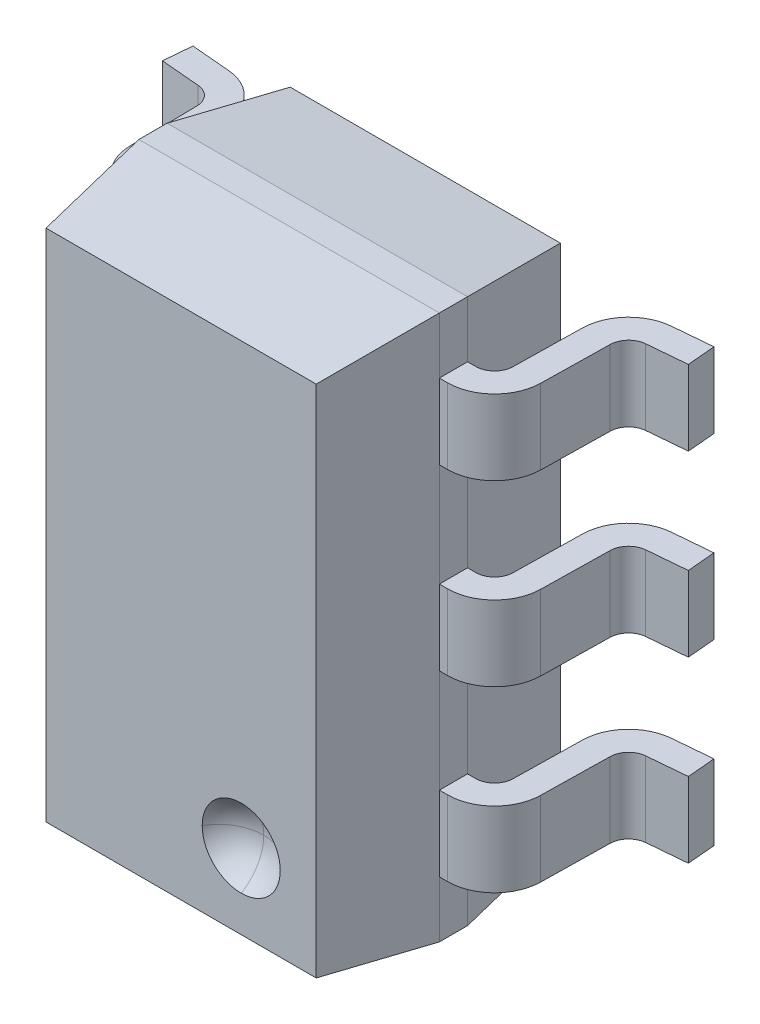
ISO-10303-21;
HEADER;
FILE_DESCRIPTION(('STEP AP214'),'2;1');
FILE_NAME('part.step','',(''),(''),'','','');
FILE_SCHEMA(('AUTOMOTIVE_DESIGN { 1 0 10303 214 1 1 1 1 }'));
ENDSEC;
DATA;
#1=APPLICATION_CONTEXT('core data for automotive mechanical design processes');
#2=APPLICATION_PROTOCOL_DEFINITION('international standard','automotive_design',2000,#1);
#3=PRODUCT_CONTEXT('',#1,'mechanical');
#4=PRODUCT('Part','Part','',(#3));
#5=PRODUCT_RELATED_PRODUCT_CATEGORY('part','',(#4));
#6=PRODUCT_DEFINITION_FORMATION('','',#4);
#7=PRODUCT_DEFINITION_CONTEXT('part definition',#1,'design');
#8=PRODUCT_DEFINITION('design','',#6,#7);
#9=PRODUCT_DEFINITION_SHAPE('','',#8);
#10=(LENGTH_UNIT() NAMED_UNIT(*) SI_UNIT(.MILLI.,.METRE.));
#11=(NAMED_UNIT(*) PLANE_ANGLE_UNIT() SI_UNIT($,.RADIAN.));
#12=(NAMED_UNIT(*) SI_UNIT($,.STERADIAN.) SOLID_ANGLE_UNIT());
#13=UNCERTAINTY_MEASURE_WITH_UNIT(LENGTH_MEASURE(1.E-05),#10,'distance_accuracy_value','');
#14=(GEOMETRIC_REPRESENTATION_CONTEXT(3) GLOBAL_UNCERTAINTY_ASSIGNED_CONTEXT((#13)) GLOBAL_UNIT_ASSIGNED_CONTEXT((#10,
#11,#12)) REPRESENTATION_CONTEXT('',''));
#15=CARTESIAN_POINT('',(0.,0.,0.));
#16=DIRECTION('',(0.,0.,1.));
#17=DIRECTION('',(1.,0.,0.));
#18=AXIS2_PLACEMENT_3D('',#15,#16,#17);
#19=CARTESIAN_POINT('',(10.12,19.53,1.57));
#20=DIRECTION('',(0.,1.,0.));
#21=DIRECTION('',(0.,0.,1.));
#22=AXIS2_PLACEMENT_3D('',#19,#20,#21);
#23=SPHERICAL_SURFACE('',#22,0.24);
#24=CARTESIAN_POINT('',(10.12,19.53,1.57));
#25=DIRECTION('',(1.,0.,0.));
#26=DIRECTION('',(0.,0.,-1.));
#27=AXIS2_PLACEMENT_3D('',#24,#25,#26);
#28=CIRCLE('',#27,0.24);
#29=CARTESIAN_POINT('',(10.12,19.53,1.33));
#30=VERTEX_POINT('',#29);
#31=CARTESIAN_POINT('',(10.12,19.7378460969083,1.45));
#32=VERTEX_POINT('',#31);
#33=EDGE_CURVE('E4494',#30,#32,#28,.T.);
#34=ORIENTED_EDGE('',*,*,#33,.T.);
#35=CARTESIAN_POINT('',(10.12,19.53,1.45));
#36=DIRECTION('',(0.,0.,1.));
#37=DIRECTION('',(0.,-1.,0.));
#38=AXIS2_PLACEMENT_3D('',#35,#36,#37);
#39=CIRCLE('',#38,0.207846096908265);
#40=CARTESIAN_POINT('',(9.91215390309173,19.53,1.45));
#41=VERTEX_POINT('',#40);
#42=EDGE_CURVE('E653',#32,#41,#39,.T.);
#43=ORIENTED_EDGE('',*,*,#42,.T.);
#44=CARTESIAN_POINT('',(10.12,19.53,1.57));
#45=DIRECTION('',(0.,1.,0.));
#46=DIRECTION('',(0.,0.,-1.));
#47=AXIS2_PLACEMENT_3D('',#44,#45,#46);
#48=CIRCLE('',#47,0.24);
#49=EDGE_CURVE('E674',#30,#41,#48,.T.);
#50=ORIENTED_EDGE('',*,*,#49,.F.);
#51=EDGE_LOOP('',(#34,#43,#50));
#52=FACE_BOUND('',#51,.T.);
#53=ADVANCED_FACE('F18',(#52),#23,.F.);
#54=CARTESIAN_POINT('',(11.1869266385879,21.65,0.));
#55=DIRECTION('',(-0.996194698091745,0.,0.087155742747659));
#56=DIRECTION('',(0.,1.,0.));
#57=AXIS2_PLACEMENT_3D('',#54,#55,#56);
#58=PLANE('',#57);
#59=DIRECTION('',(-0.087155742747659,0.,-0.996194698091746));
#60=VECTOR('',#59,1.);
#61=CARTESIAN_POINT('',(11.1869266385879,21.25,0.));
#62=LINE('',#61,#60);
#63=CARTESIAN_POINT('',(11.2,21.25,0.149429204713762));
#64=VERTEX_POINT('',#63);
#65=CARTESIAN_POINT('',(11.1869266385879,21.25,0.));
#66=VERTEX_POINT('',#65);
#67=EDGE_CURVE('E1352',#64,#66,#62,.T.);
#68=ORIENTED_EDGE('',*,*,#67,.T.);
#69=DIRECTION('',(0.,-1.,0.));
#70=VECTOR('',#69,1.);
#71=CARTESIAN_POINT('',(11.1869266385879,21.65,0.));
#72=LINE('',#71,#70);
#73=CARTESIAN_POINT('',(11.1869266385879,21.65,0.));
#74=VERTEX_POINT('',#73);
#75=EDGE_CURVE('E1237',#74,#66,#72,.T.);
#76=ORIENTED_EDGE('',*,*,#75,.F.);
#77=DIRECTION('',(-0.087155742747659,0.,-0.996194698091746));
#78=VECTOR('',#77,1.);
#79=CARTESIAN_POINT('',(11.1869266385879,21.65,0.));
#80=LINE('',#79,#78);
#81=CARTESIAN_POINT('',(11.2,21.65,0.149429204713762));
#82=VERTEX_POINT('',#81);
#83=EDGE_CURVE('E1383',#82,#74,#80,.T.);
#84=ORIENTED_EDGE('',*,*,#83,.F.);
#85=DIRECTION('',(0.,-1.,0.));
#86=VECTOR('',#85,1.);
#87=CARTESIAN_POINT('',(11.2,21.65,0.149429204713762));
#88=LINE('',#87,#86);
#89=EDGE_CURVE('E11',#82,#64,#88,.T.);
#90=ORIENTED_EDGE('',*,*,#89,.T.);
#91=EDGE_LOOP('',(#68,#76,#84,#90));
#92=FACE_BOUND('',#91,.T.);
#93=ADVANCED_FACE('F1527',(#92),#58,.F.);
#94=CARTESIAN_POINT('',(11.2,21.65,0.149429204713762));
#95=DIRECTION('',(-0.0871557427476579,0.,-0.996194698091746));
#96=DIRECTION('',(-0.996194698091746,0.,0.0871557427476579));
#97=AXIS2_PLACEMENT_3D('',#94,#95,#96);
#98=PLANE('',#97);
#99=DIRECTION('',(0.996194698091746,0.,-0.0871557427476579));
#100=VECTOR('',#99,1.);
#101=CARTESIAN_POINT('',(11.2,21.25,0.149429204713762));
#102=LINE('',#101,#100);
#103=CARTESIAN_POINT('',(10.9912463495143,21.25,0.167692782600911));
#104=VERTEX_POINT('',#103);
#105=EDGE_CURVE('E1347',#104,#64,#102,.T.);
#106=ORIENTED_EDGE('',*,*,#105,.T.);
#107=ORIENTED_EDGE('',*,*,#89,.F.);
#108=DIRECTION('',(0.996194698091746,0.,-0.0871557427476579));
#109=VECTOR('',#108,1.);
#110=CARTESIAN_POINT('',(11.2,21.65,0.149429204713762));
#111=LINE('',#110,#109);
#112=CARTESIAN_POINT('',(10.9912463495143,21.65,0.167692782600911));
#113=VERTEX_POINT('',#112);
#114=EDGE_CURVE('E1379',#113,#82,#111,.T.);
#115=ORIENTED_EDGE('',*,*,#114,.F.);
#116=DIRECTION('',(0.,-1.,0.));
#117=VECTOR('',#116,1.);
#118=CARTESIAN_POINT('',(10.9912463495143,21.65,0.167692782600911));
#119=LINE('',#118,#117);
#120=EDGE_CURVE('E26',#113,#104,#119,.T.);
#121=ORIENTED_EDGE('',*,*,#120,.T.);
#122=EDGE_LOOP('',(#106,#107,#115,#121));
#123=FACE_BOUND('',#122,.T.);
#124=ADVANCED_FACE('F1521',(#123),#98,.F.);
#125=CARTESIAN_POINT('',(10.9999619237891,21.65,0.267312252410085));
#126=DIRECTION('',(0.,1.,0.));
#127=DIRECTION('',(0.,0.,1.));
#128=AXIS2_PLACEMENT_3D('',#125,#126,#127);
#129=CYLINDRICAL_SURFACE('',#128,0.1);
#130=CARTESIAN_POINT('',(10.9999619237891,21.25,0.267312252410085));
#131=DIRECTION('',(0.,-1.,0.));
#132=DIRECTION('',(0.,0.,-1.));
#133=AXIS2_PLACEMENT_3D('',#130,#131,#132);
#134=CIRCLE('',#133,0.1);
#135=CARTESIAN_POINT('',(10.8999771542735,21.25,0.265567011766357));
#136=VERTEX_POINT('',#135);
#137=EDGE_CURVE('E1351',#136,#104,#134,.T.);
#138=ORIENTED_EDGE('',*,*,#137,.T.);
#139=ORIENTED_EDGE('',*,*,#120,.F.);
#140=CARTESIAN_POINT('',(10.9999619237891,21.65,0.267312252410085));
#141=DIRECTION('',(0.,-1.,0.));
#142=DIRECTION('',(0.,0.,-1.));
#143=AXIS2_PLACEMENT_3D('',#140,#141,#142);
#144=CIRCLE('',#143,0.1);
#145=CARTESIAN_POINT('',(10.8999771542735,21.65,0.265567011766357));
#146=VERTEX_POINT('',#145);
#147=EDGE_CURVE('E1375',#146,#113,#144,.T.);
#148=ORIENTED_EDGE('',*,*,#147,.F.);
#149=DIRECTION('',(0.,-1.,0.));
#150=VECTOR('',#149,1.);
#151=CARTESIAN_POINT('',(10.8999771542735,21.65,0.265567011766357));
#152=LINE('',#151,#150);
#153=EDGE_CURVE('E50',#146,#136,#152,.T.);
#154=ORIENTED_EDGE('',*,*,#153,.T.);
#155=EDGE_LOOP('',(#138,#139,#148,#154));
#156=FACE_BOUND('',#155,.T.);
#157=ADVANCED_FACE('F1526',(#156),#129,.F.);
#158=CARTESIAN_POINT('',(10.8999771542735,21.65,0.265567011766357));
#159=DIRECTION('',(-0.999847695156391,0.,-0.0174524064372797));
#160=DIRECTION('',(-0.0174524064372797,0.,0.999847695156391));
#161=AXIS2_PLACEMENT_3D('',#158,#159,#160);
#162=PLANE('',#161);
#163=DIRECTION('',(0.0174524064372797,0.,-0.999847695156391));
#164=VECTOR('',#163,1.);
#165=CARTESIAN_POINT('',(10.8999771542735,21.25,0.265567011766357));
#166=LINE('',#165,#164);
#167=CARTESIAN_POINT('',(10.8936270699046,21.25,0.62936310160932));
#168=VERTEX_POINT('',#167);
#169=EDGE_CURVE('E1421',#168,#136,#166,.T.);
#170=ORIENTED_EDGE('',*,*,#169,.T.);
#171=ORIENTED_EDGE('',*,*,#153,.F.);
#172=DIRECTION('',(0.0174524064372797,0.,-0.999847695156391));
#173=VECTOR('',#172,1.);
#174=CARTESIAN_POINT('',(10.8999771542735,21.65,0.265567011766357));
#175=LINE('',#174,#173);
#176=CARTESIAN_POINT('',(10.8936270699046,21.65,0.62936310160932));
#177=VERTEX_POINT('',#176);
#178=EDGE_CURVE('E1371',#177,#146,#175,.T.);
#179=ORIENTED_EDGE('',*,*,#178,.F.);
#180=DIRECTION('',(0.,-1.,0.));
#181=VECTOR('',#180,1.);
#182=CARTESIAN_POINT('',(10.8936270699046,21.65,0.62936310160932));
#183=LINE('',#182,#181);
#184=EDGE_CURVE('E39',#177,#168,#183,.T.);
#185=ORIENTED_EDGE('',*,*,#184,.T.);
#186=EDGE_LOOP('',(#170,#171,#179,#185));
#187=FACE_BOUND('',#186,.T.);
#188=ADVANCED_FACE('F1735',(#187),#162,.F.);
#189=CARTESIAN_POINT('',(10.6436651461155,21.65,0.625));
#190=DIRECTION('',(0.,1.,0.));
#191=DIRECTION('',(0.,0.,1.));
#192=AXIS2_PLACEMENT_3D('',#189,#190,#191);
#193=CYLINDRICAL_SURFACE('',#192,0.25);
#194=CARTESIAN_POINT('',(10.6436651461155,21.25,0.625));
#195=DIRECTION('',(0.,1.,0.));
#196=DIRECTION('',(0.,0.,1.));
#197=AXIS2_PLACEMENT_3D('',#194,#195,#196);
#198=CIRCLE('',#197,0.25);
#199=CARTESIAN_POINT('',(10.6436651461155,21.25,0.875));
#200=VERTEX_POINT('',#199);
#201=EDGE_CURVE('E1424',#200,#168,#198,.T.);
#202=ORIENTED_EDGE('',*,*,#201,.T.);
#203=ORIENTED_EDGE('',*,*,#184,.F.);
#204=CARTESIAN_POINT('',(10.6436651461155,21.65,0.625));
#205=DIRECTION('',(0.,1.,0.));
#206=DIRECTION('',(0.,0.,1.));
#207=AXIS2_PLACEMENT_3D('',#204,#205,#206);
#208=CIRCLE('',#207,0.25);
#209=CARTESIAN_POINT('',(10.6436651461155,21.65,0.875));
#210=VERTEX_POINT('',#209);
#211=EDGE_CURVE('E1363',#210,#177,#208,.T.);
#212=ORIENTED_EDGE('',*,*,#211,.F.);
#213=DIRECTION('',(0.,-1.,0.));
#214=VECTOR('',#213,1.);
#215=CARTESIAN_POINT('',(10.6436651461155,21.65,0.875));
#216=LINE('',#215,#214);
#217=EDGE_CURVE('E1238',#210,#200,#216,.T.);
#218=ORIENTED_EDGE('',*,*,#217,.T.);
#219=EDGE_LOOP('',(#202,#203,#212,#218));
#220=FACE_BOUND('',#219,.T.);
#221=ADVANCED_FACE('F1554',(#220),#193,.T.);
#222=CARTESIAN_POINT('',(8.95633485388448,21.65,0.725));
#223=DIRECTION('',(0.,0.,1.));
#224=DIRECTION('',(1.,0.,0.));
#225=AXIS2_PLACEMENT_3D('',#222,#223,#224);
#226=PLANE('',#225);
#227=DIRECTION('',(0.,1.,0.));
#228=VECTOR('',#227,1.);
#229=CARTESIAN_POINT('',(10.6,21.95,0.725000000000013));
#230=LINE('',#229,#228);
#231=CARTESIAN_POINT('',(10.6,21.25,0.725000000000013));
#232=VERTEX_POINT('',#231);
#233=CARTESIAN_POINT('',(10.6,21.65,0.725000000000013));
#234=VERTEX_POINT('',#233);
#235=EDGE_CURVE('E612',#232,#234,#230,.T.);
#236=ORIENTED_EDGE('',*,*,#235,.T.);
#237=DIRECTION('',(-1.,0.,0.));
#238=VECTOR('',#237,1.);
#239=CARTESIAN_POINT('',(8.95633485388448,21.65,0.725));
#240=LINE('',#239,#238);
#241=CARTESIAN_POINT('',(10.6436651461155,21.65,0.725));
#242=VERTEX_POINT('',#241);
#243=EDGE_CURVE('E1397',#242,#234,#240,.T.);
#244=ORIENTED_EDGE('',*,*,#243,.F.);
#245=DIRECTION('',(0.,-1.,0.));
#246=VECTOR('',#245,1.);
#247=CARTESIAN_POINT('',(10.6436651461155,21.65,0.725));
#248=LINE('',#247,#246);
#249=CARTESIAN_POINT('',(10.6436651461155,21.25,0.725));
#250=VERTEX_POINT('',#249);
#251=EDGE_CURVE('E614',#242,#250,#248,.T.);
#252=ORIENTED_EDGE('',*,*,#251,.T.);
#253=DIRECTION('',(-1.,0.,0.));
#254=VECTOR('',#253,1.);
#255=CARTESIAN_POINT('',(8.95633485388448,21.25,0.725));
#256=LINE('',#255,#254);
#257=EDGE_CURVE('E608',#250,#232,#256,.T.);
#258=ORIENTED_EDGE('',*,*,#257,.T.);
#259=EDGE_LOOP('',(#236,#244,#252,#258));
#260=FACE_BOUND('',#259,.T.);
#261=ADVANCED_FACE('F610',(#260),#226,.F.);
#262=CARTESIAN_POINT('',(10.6436651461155,21.65,0.625));
#263=DIRECTION('',(0.,1.,0.));
#264=DIRECTION('',(0.,0.,1.));
#265=AXIS2_PLACEMENT_3D('',#262,#263,#264);
#266=CYLINDRICAL_SURFACE('',#265,0.1);
#267=CARTESIAN_POINT('',(10.6436651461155,21.25,0.625));
#268=DIRECTION('',(0.,-1.,0.));
#269=DIRECTION('',(0.,0.,-1.));
#270=AXIS2_PLACEMENT_3D('',#267,#268,#269);
#271=CIRCLE('',#270,0.1);
#272=CARTESIAN_POINT('',(10.7436499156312,21.25,0.626745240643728));
#273=VERTEX_POINT('',#272);
#274=EDGE_CURVE('E620',#273,#250,#271,.T.);
#275=ORIENTED_EDGE('',*,*,#274,.T.);
#276=ORIENTED_EDGE('',*,*,#251,.F.);
#277=CARTESIAN_POINT('',(10.6436651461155,21.65,0.625));
#278=DIRECTION('',(0.,-1.,0.));
#279=DIRECTION('',(0.,0.,-1.));
#280=AXIS2_PLACEMENT_3D('',#277,#278,#279);
#281=CIRCLE('',#280,0.1);
#282=CARTESIAN_POINT('',(10.7436499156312,21.65,0.626745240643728));
#283=VERTEX_POINT('',#282);
#284=EDGE_CURVE('E1393',#283,#242,#281,.T.);
#285=ORIENTED_EDGE('',*,*,#284,.F.);
#286=DIRECTION('',(0.,-1.,0.));
#287=VECTOR('',#286,1.);
#288=CARTESIAN_POINT('',(10.7436499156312,21.65,0.626745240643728));
#289=LINE('',#288,#287);
#290=EDGE_CURVE('E1364',#283,#273,#289,.T.);
#291=ORIENTED_EDGE('',*,*,#290,.T.);
#292=EDGE_LOOP('',(#275,#276,#285,#291));
#293=FACE_BOUND('',#292,.T.);
#294=ADVANCED_FACE('F1553',(#293),#266,.F.);
#295=CARTESIAN_POINT('',(10.7436499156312,21.65,0.626745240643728));
#296=DIRECTION('',(0.999847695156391,0.,0.01745240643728));
#297=DIRECTION('',(0.,-1.,0.));
#298=AXIS2_PLACEMENT_3D('',#295,#296,#297);
#299=PLANE('',#298);
#300=DIRECTION('',(-0.01745240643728,0.,0.999847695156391));
#301=VECTOR('',#300,1.);
#302=CARTESIAN_POINT('',(10.7436499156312,21.25,0.626745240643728));
#303=LINE('',#302,#301);
#304=CARTESIAN_POINT('',(10.75,21.25,0.262949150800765));
#305=VERTEX_POINT('',#304);
#306=EDGE_CURVE('E1404',#305,#273,#303,.T.);
#307=ORIENTED_EDGE('',*,*,#306,.T.);
#308=ORIENTED_EDGE('',*,*,#290,.F.);
#309=DIRECTION('',(-0.01745240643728,0.,0.999847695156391));
#310=VECTOR('',#309,1.);
#311=CARTESIAN_POINT('',(10.7436499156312,21.65,0.626745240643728));
#312=LINE('',#311,#310);
#313=CARTESIAN_POINT('',(10.75,21.65,0.262949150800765));
#314=VERTEX_POINT('',#313);
#315=EDGE_CURVE('E923',#314,#283,#312,.T.);
#316=ORIENTED_EDGE('',*,*,#315,.F.);
#317=DIRECTION('',(0.,-1.,0.));
#318=VECTOR('',#317,1.);
#319=CARTESIAN_POINT('',(10.75,21.65,0.262949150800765));
#320=LINE('',#319,#318);
#321=EDGE_CURVE('E1367',#314,#305,#320,.T.);
#322=ORIENTED_EDGE('',*,*,#321,.T.);
#323=EDGE_LOOP('',(#307,#308,#316,#322));
#324=FACE_BOUND('',#323,.T.);
#325=ADVANCED_FACE('F2247',(#324),#299,.F.);
#326=CARTESIAN_POINT('',(10.9999619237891,21.65,0.267312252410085));
#327=DIRECTION('',(0.,1.,0.));
#328=DIRECTION('',(0.,0.,1.));
#329=AXIS2_PLACEMENT_3D('',#326,#327,#328);
#330=CYLINDRICAL_SURFACE('',#329,0.25);
#331=CARTESIAN_POINT('',(10.9999619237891,21.25,0.267312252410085));
#332=DIRECTION('',(0.,1.,0.));
#333=DIRECTION('',(0.,0.,1.));
#334=AXIS2_PLACEMENT_3D('',#331,#332,#333);
#335=CIRCLE('',#334,0.25);
#336=CARTESIAN_POINT('',(10.9781729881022,21.25,0.0182635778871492));
#337=VERTEX_POINT('',#336);
#338=EDGE_CURVE('E1408',#337,#305,#335,.T.);
#339=ORIENTED_EDGE('',*,*,#338,.T.);
#340=ORIENTED_EDGE('',*,*,#321,.F.);
#341=CARTESIAN_POINT('',(10.9999619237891,21.65,0.267312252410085));
#342=DIRECTION('',(0.,1.,0.));
#343=DIRECTION('',(0.,0.,1.));
#344=AXIS2_PLACEMENT_3D('',#341,#342,#343);
#345=CIRCLE('',#344,0.25);
#346=CARTESIAN_POINT('',(10.9781729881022,21.65,0.0182635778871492));
#347=VERTEX_POINT('',#346);
#348=EDGE_CURVE('E919',#347,#314,#345,.T.);
#349=ORIENTED_EDGE('',*,*,#348,.F.);
#350=DIRECTION('',(0.,-1.,0.));
#351=VECTOR('',#350,1.);
#352=CARTESIAN_POINT('',(10.9781729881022,21.65,0.0182635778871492));
#353=LINE('',#352,#351);
#354=EDGE_CURVE('E1234',#347,#337,#353,.T.);
#355=ORIENTED_EDGE('',*,*,#354,.T.);
#356=EDGE_LOOP('',(#339,#340,#349,#355));
#357=FACE_BOUND('',#356,.T.);
#358=ADVANCED_FACE('F1889',(#357),#330,.T.);
#359=CARTESIAN_POINT('',(10.9781729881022,21.65,0.0182635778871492));
#360=DIRECTION('',(0.0871557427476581,0.,0.996194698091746));
#361=DIRECTION('',(0.,-1.,0.));
#362=AXIS2_PLACEMENT_3D('',#359,#360,#361);
#363=PLANE('',#362);
#364=DIRECTION('',(-0.996194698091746,0.,0.0871557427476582));
#365=VECTOR('',#364,1.);
#366=CARTESIAN_POINT('',(10.9781729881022,21.25,0.0182635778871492));
#367=LINE('',#366,#365);
#368=EDGE_CURVE('E1412',#66,#337,#367,.T.);
#369=ORIENTED_EDGE('',*,*,#368,.T.);
#370=ORIENTED_EDGE('',*,*,#354,.F.);
#371=DIRECTION('',(-0.996194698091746,0.,0.0871557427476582));
#372=VECTOR('',#371,1.);
#373=CARTESIAN_POINT('',(10.9781729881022,21.65,0.0182635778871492));
#374=LINE('',#373,#372);
#375=EDGE_CURVE('E924',#74,#347,#374,.T.);
#376=ORIENTED_EDGE('',*,*,#375,.F.);
#377=ORIENTED_EDGE('',*,*,#75,.T.);
#378=EDGE_LOOP('',(#369,#370,#376,#377));
#379=FACE_BOUND('',#378,.T.);
#380=ADVANCED_FACE('F1883',(#379),#363,.F.);
#381=CARTESIAN_POINT('',(10.6436651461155,21.65,0.875));
#382=DIRECTION('',(0.,0.,-1.));
#383=DIRECTION('',(0.,-1.,0.));
#384=AXIS2_PLACEMENT_3D('',#381,#382,#383);
#385=PLANE('',#384);
#386=DIRECTION('',(0.,1.,0.));
#387=VECTOR('',#386,1.);
#388=CARTESIAN_POINT('',(10.6,21.95,0.875));
#389=LINE('',#388,#387);
#390=CARTESIAN_POINT('',(10.6,21.25,0.875));
#391=VERTEX_POINT('',#390);
#392=CARTESIAN_POINT('',(10.6,21.65,0.874999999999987));
#393=VERTEX_POINT('',#392);
#394=EDGE_CURVE('E702',#391,#393,#389,.T.);
#395=ORIENTED_EDGE('',*,*,#394,.F.);
#396=DIRECTION('',(1.,0.,0.));
#397=VECTOR('',#396,1.);
#398=CARTESIAN_POINT('',(10.6436651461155,21.25,0.875));
#399=LINE('',#398,#397);
#400=EDGE_CURVE('E621',#391,#200,#399,.T.);
#401=ORIENTED_EDGE('',*,*,#400,.T.);
#402=ORIENTED_EDGE('',*,*,#217,.F.);
#403=DIRECTION('',(1.,0.,0.));
#404=VECTOR('',#403,1.);
#405=CARTESIAN_POINT('',(10.6436651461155,21.65,0.875));
#406=LINE('',#405,#404);
#407=EDGE_CURVE('E1359',#393,#210,#406,.T.);
#408=ORIENTED_EDGE('',*,*,#407,.F.);
#409=EDGE_LOOP('',(#395,#401,#402,#408));
#410=FACE_BOUND('',#409,.T.);
#411=ADVANCED_FACE('F1888',(#410),#385,.F.);
#412=CARTESIAN_POINT('',(10.9999619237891,21.25,0.267312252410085));
#413=DIRECTION('',(0.,1.,0.));
#414=DIRECTION('',(1.,0.,0.));
#415=AXIS2_PLACEMENT_3D('',#412,#413,#414);
#416=PLANE('',#415);
#417=ORIENTED_EDGE('',*,*,#400,.F.);
#418=DIRECTION('',(0.,0.,-1.));
#419=VECTOR('',#418,1.);
#420=CARTESIAN_POINT('',(10.6,21.25,1.45));
#421=LINE('',#420,#419);
#422=EDGE_CURVE('E641',#391,#232,#421,.T.);
#423=ORIENTED_EDGE('',*,*,#422,.T.);
#424=ORIENTED_EDGE('',*,*,#257,.F.);
#425=ORIENTED_EDGE('',*,*,#274,.F.);
#426=ORIENTED_EDGE('',*,*,#306,.F.);
#427=ORIENTED_EDGE('',*,*,#338,.F.);
#428=ORIENTED_EDGE('',*,*,#368,.F.);
#429=ORIENTED_EDGE('',*,*,#67,.F.);
#430=ORIENTED_EDGE('',*,*,#105,.F.);
#431=ORIENTED_EDGE('',*,*,#137,.F.);
#432=ORIENTED_EDGE('',*,*,#169,.F.);
#433=ORIENTED_EDGE('',*,*,#201,.F.);
#434=EDGE_LOOP('',(#417,#423,#424,#425,#426,#427,#428,#429,#430,#431,#432,#433));
#435=FACE_BOUND('',#434,.T.);
#436=ADVANCED_FACE('F647',(#435),#416,.F.);
#437=CARTESIAN_POINT('',(10.9999619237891,21.65,0.267312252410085));
#438=DIRECTION('',(0.,1.,0.));
#439=DIRECTION('',(1.,0.,0.));
#440=AXIS2_PLACEMENT_3D('',#437,#438,#439);
#441=PLANE('',#440);
#442=DIRECTION('',(0.,0.,-1.));
#443=VECTOR('',#442,1.);
#444=CARTESIAN_POINT('',(10.6,21.65,1.45));
#445=LINE('',#444,#443);
#446=EDGE_CURVE('E738',#393,#234,#445,.T.);
#447=ORIENTED_EDGE('',*,*,#446,.F.);
#448=ORIENTED_EDGE('',*,*,#407,.T.);
#449=ORIENTED_EDGE('',*,*,#211,.T.);
#450=ORIENTED_EDGE('',*,*,#178,.T.);
#451=ORIENTED_EDGE('',*,*,#147,.T.);
#452=ORIENTED_EDGE('',*,*,#114,.T.);
#453=ORIENTED_EDGE('',*,*,#83,.T.);
#454=ORIENTED_EDGE('',*,*,#375,.T.);
#455=ORIENTED_EDGE('',*,*,#348,.T.);
#456=ORIENTED_EDGE('',*,*,#315,.T.);
#457=ORIENTED_EDGE('',*,*,#284,.T.);
#458=ORIENTED_EDGE('',*,*,#243,.T.);
#459=EDGE_LOOP('',(#447,#448,#449,#450,#451,#452,#453,#454,#455,#456,#457,#458));
#460=FACE_BOUND('',#459,.T.);
#461=ADVANCED_FACE('F1693',(#460),#441,.T.);
#462=CARTESIAN_POINT('',(10.9999619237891,21.65,0.267312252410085));
#463=DIRECTION('',(0.,1.,0.));
#464=DIRECTION('',(1.,0.,0.));
#465=AXIS2_PLACEMENT_3D('',#462,#463,#464);
#466=PLANE('',#465);
#467=DIRECTION('',(0.,0.,1.));
#468=VECTOR('',#467,1.);
#469=CARTESIAN_POINT('',(9.,21.65,1.45));
#470=LINE('',#469,#468);
#471=CARTESIAN_POINT('',(9.,21.65,0.725000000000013));
#472=VERTEX_POINT('',#471);
#473=CARTESIAN_POINT('',(9.,21.65,0.875));
#474=VERTEX_POINT('',#473);
#475=EDGE_CURVE('E918',#472,#474,#470,.T.);
#476=ORIENTED_EDGE('',*,*,#475,.F.);
#477=DIRECTION('',(-1.,0.,0.));
#478=VECTOR('',#477,1.);
#479=CARTESIAN_POINT('',(8.95633485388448,21.65,0.725));
#480=LINE('',#479,#478);
#481=CARTESIAN_POINT('',(8.95633485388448,21.65,0.725));
#482=VERTEX_POINT('',#481);
#483=EDGE_CURVE('E1358',#472,#482,#480,.T.);
#484=ORIENTED_EDGE('',*,*,#483,.T.);
#485=CARTESIAN_POINT('',(8.95633485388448,21.65,0.625));
#486=DIRECTION('',(0.,-1.,0.));
#487=DIRECTION('',(0.,0.,-1.));
#488=AXIS2_PLACEMENT_3D('',#485,#486,#487);
#489=CIRCLE('',#488,0.1);
#490=CARTESIAN_POINT('',(8.85635008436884,21.65,0.626745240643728));
#491=VERTEX_POINT('',#490);
#492=EDGE_CURVE('E1330',#482,#491,#489,.T.);
#493=ORIENTED_EDGE('',*,*,#492,.T.);
#494=DIRECTION('',(-0.01745240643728,0.,-0.999847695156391));
#495=VECTOR('',#494,1.);
#496=CARTESIAN_POINT('',(8.85,21.65,0.262949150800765));
#497=LINE('',#496,#495);
#498=CARTESIAN_POINT('',(8.85,21.65,0.262949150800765));
#499=VERTEX_POINT('',#498);
#500=EDGE_CURVE('E1270',#491,#499,#497,.T.);
#501=ORIENTED_EDGE('',*,*,#500,.T.);
#502=CARTESIAN_POINT('',(8.6000380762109,21.65,0.267312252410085));
#503=DIRECTION('',(0.,1.,0.));
#504=DIRECTION('',(0.,0.,1.));
#505=AXIS2_PLACEMENT_3D('',#502,#503,#504);
#506=CIRCLE('',#505,0.25);
#507=CARTESIAN_POINT('',(8.62182701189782,21.65,0.0182635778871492));
#508=VERTEX_POINT('',#507);
#509=EDGE_CURVE('E730',#499,#508,#506,.T.);
#510=ORIENTED_EDGE('',*,*,#509,.T.);
#511=DIRECTION('',(-0.996194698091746,0.,-0.0871557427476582));
#512=VECTOR('',#511,1.);
#513=CARTESIAN_POINT('',(8.41307336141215,21.65,0.));
#514=LINE('',#513,#512);
#515=CARTESIAN_POINT('',(8.41307336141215,21.65,0.));
#516=VERTEX_POINT('',#515);
#517=EDGE_CURVE('E1036',#508,#516,#514,.T.);
#518=ORIENTED_EDGE('',*,*,#517,.T.);
#519=DIRECTION('',(-0.0871557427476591,0.,0.996194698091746));
#520=VECTOR('',#519,1.);
#521=CARTESIAN_POINT('',(8.4,21.65,0.149429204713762));
#522=LINE('',#521,#520);
#523=CARTESIAN_POINT('',(8.4,21.65,0.149429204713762));
#524=VERTEX_POINT('',#523);
#525=EDGE_CURVE('E1084',#516,#524,#522,.T.);
#526=ORIENTED_EDGE('',*,*,#525,.T.);
#527=DIRECTION('',(0.996194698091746,0.,0.0871557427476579));
#528=VECTOR('',#527,1.);
#529=CARTESIAN_POINT('',(8.60875365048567,21.65,0.167692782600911));
#530=LINE('',#529,#528);
#531=CARTESIAN_POINT('',(8.60875365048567,21.65,0.167692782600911));
#532=VERTEX_POINT('',#531);
#533=EDGE_CURVE('E834',#524,#532,#530,.T.);
#534=ORIENTED_EDGE('',*,*,#533,.T.);
#535=CARTESIAN_POINT('',(8.6000380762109,21.65,0.267312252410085));
#536=DIRECTION('',(0.,-1.,0.));
#537=DIRECTION('',(0.,0.,-1.));
#538=AXIS2_PLACEMENT_3D('',#535,#536,#537);
#539=CIRCLE('',#538,0.1);
#540=CARTESIAN_POINT('',(8.70002284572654,21.65,0.265567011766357));
#541=VERTEX_POINT('',#540);
#542=EDGE_CURVE('E1311',#532,#541,#539,.T.);
#543=ORIENTED_EDGE('',*,*,#542,.T.);
#544=DIRECTION('',(0.0174524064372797,0.,0.999847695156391));
#545=VECTOR('',#544,1.);
#546=CARTESIAN_POINT('',(8.70637293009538,21.65,0.62936310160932));
#547=LINE('',#546,#545);
#548=CARTESIAN_POINT('',(8.70637293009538,21.65,0.62936310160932));
#549=VERTEX_POINT('',#548);
#550=EDGE_CURVE('E1320',#541,#549,#547,.T.);
#551=ORIENTED_EDGE('',*,*,#550,.T.);
#552=CARTESIAN_POINT('',(8.95633485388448,21.65,0.625));
#553=DIRECTION('',(0.,1.,0.));
#554=DIRECTION('',(0.,0.,1.));
#555=AXIS2_PLACEMENT_3D('',#552,#553,#554);
#556=CIRCLE('',#555,0.25);
#557=CARTESIAN_POINT('',(8.95633485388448,21.65,0.875));
#558=VERTEX_POINT('',#557);
#559=EDGE_CURVE('E949',#549,#558,#556,.T.);
#560=ORIENTED_EDGE('',*,*,#559,.T.);
#561=DIRECTION('',(1.,0.,0.));
#562=VECTOR('',#561,1.);
#563=CARTESIAN_POINT('',(10.6436651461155,21.65,0.875));
#564=LINE('',#563,#562);
#565=EDGE_CURVE('E953',#558,#474,#564,.T.);
#566=ORIENTED_EDGE('',*,*,#565,.T.);
#567=EDGE_LOOP('',(#476,#484,#493,#501,#510,#518,#526,#534,#543,#551,#560,#566));
#568=FACE_BOUND('',#567,.T.);
#569=ADVANCED_FACE('F1687',(#568),#466,.T.);
#570=CARTESIAN_POINT('',(10.9999619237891,21.25,0.267312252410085));
#571=DIRECTION('',(0.,1.,0.));
#572=DIRECTION('',(1.,0.,0.));
#573=AXIS2_PLACEMENT_3D('',#570,#571,#572);
#574=PLANE('',#573);
#575=DIRECTION('',(-1.,0.,0.));
#576=VECTOR('',#575,1.);
#577=CARTESIAN_POINT('',(8.95633485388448,21.25,0.725));
#578=LINE('',#577,#576);
#579=CARTESIAN_POINT('',(9.,21.25,0.725000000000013));
#580=VERTEX_POINT('',#579);
#581=CARTESIAN_POINT('',(8.95633485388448,21.25,0.725));
#582=VERTEX_POINT('',#581);
#583=EDGE_CURVE('E1355',#580,#582,#578,.T.);
#584=ORIENTED_EDGE('',*,*,#583,.F.);
#585=DIRECTION('',(0.,0.,1.));
#586=VECTOR('',#585,1.);
#587=CARTESIAN_POINT('',(9.,21.25,1.45));
#588=LINE('',#587,#586);
#589=CARTESIAN_POINT('',(9.,21.25,0.874999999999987));
#590=VERTEX_POINT('',#589);
#591=EDGE_CURVE('E762',#580,#590,#588,.T.);
#592=ORIENTED_EDGE('',*,*,#591,.T.);
#593=DIRECTION('',(1.,0.,0.));
#594=VECTOR('',#593,1.);
#595=CARTESIAN_POINT('',(10.6436651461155,21.25,0.875));
#596=LINE('',#595,#594);
#597=CARTESIAN_POINT('',(8.95633485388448,21.25,0.875));
#598=VERTEX_POINT('',#597);
#599=EDGE_CURVE('E1346',#598,#590,#596,.T.);
#600=ORIENTED_EDGE('',*,*,#599,.F.);
#601=CARTESIAN_POINT('',(8.95633485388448,21.25,0.625));
#602=DIRECTION('',(0.,1.,0.));
#603=DIRECTION('',(0.,0.,1.));
#604=AXIS2_PLACEMENT_3D('',#601,#602,#603);
#605=CIRCLE('',#604,0.25);
#606=CARTESIAN_POINT('',(8.70637293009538,21.25,0.62936310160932));
#607=VERTEX_POINT('',#606);
#608=EDGE_CURVE('E1337',#607,#598,#605,.T.);
#609=ORIENTED_EDGE('',*,*,#608,.F.);
#610=DIRECTION('',(0.0174524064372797,0.,0.999847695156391));
#611=VECTOR('',#610,1.);
#612=CARTESIAN_POINT('',(8.70637293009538,21.25,0.62936310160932));
#613=LINE('',#612,#611);
#614=CARTESIAN_POINT('',(8.70002284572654,21.25,0.265567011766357));
#615=VERTEX_POINT('',#614);
#616=EDGE_CURVE('E1315',#615,#607,#613,.T.);
#617=ORIENTED_EDGE('',*,*,#616,.F.);
#618=CARTESIAN_POINT('',(8.6000380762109,21.25,0.267312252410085));
#619=DIRECTION('',(0.,-1.,0.));
#620=DIRECTION('',(0.,0.,-1.));
#621=AXIS2_PLACEMENT_3D('',#618,#619,#620);
#622=CIRCLE('',#621,0.1);
#623=CARTESIAN_POINT('',(8.60875365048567,21.25,0.167692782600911));
#624=VERTEX_POINT('',#623);
#625=EDGE_CURVE('E1303',#624,#615,#622,.T.);
#626=ORIENTED_EDGE('',*,*,#625,.F.);
#627=DIRECTION('',(0.996194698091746,0.,0.0871557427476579));
#628=VECTOR('',#627,1.);
#629=CARTESIAN_POINT('',(8.60875365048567,21.25,0.167692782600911));
#630=LINE('',#629,#628);
#631=CARTESIAN_POINT('',(8.4,21.25,0.149429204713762));
#632=VERTEX_POINT('',#631);
#633=EDGE_CURVE('E835',#632,#624,#630,.T.);
#634=ORIENTED_EDGE('',*,*,#633,.F.);
#635=DIRECTION('',(-0.0871557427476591,0.,0.996194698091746));
#636=VECTOR('',#635,1.);
#637=CARTESIAN_POINT('',(8.4,21.25,0.149429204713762));
#638=LINE('',#637,#636);
#639=CARTESIAN_POINT('',(8.41307336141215,21.25,0.));
#640=VERTEX_POINT('',#639);
#641=EDGE_CURVE('E1040',#640,#632,#638,.T.);
#642=ORIENTED_EDGE('',*,*,#641,.F.);
#643=DIRECTION('',(-0.996194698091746,0.,-0.0871557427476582));
#644=VECTOR('',#643,1.);
#645=CARTESIAN_POINT('',(8.41307336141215,21.25,0.));
#646=LINE('',#645,#644);
#647=CARTESIAN_POINT('',(8.62182701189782,21.25,0.0182635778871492));
#648=VERTEX_POINT('',#647);
#649=EDGE_CURVE('E1284',#648,#640,#646,.T.);
#650=ORIENTED_EDGE('',*,*,#649,.F.);
#651=CARTESIAN_POINT('',(8.6000380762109,21.25,0.267312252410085));
#652=DIRECTION('',(0.,1.,0.));
#653=DIRECTION('',(0.,0.,1.));
#654=AXIS2_PLACEMENT_3D('',#651,#652,#653);
#655=CIRCLE('',#654,0.25);
#656=CARTESIAN_POINT('',(8.85,21.25,0.262949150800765));
#657=VERTEX_POINT('',#656);
#658=EDGE_CURVE('E731',#657,#648,#655,.T.);
#659=ORIENTED_EDGE('',*,*,#658,.F.);
#660=DIRECTION('',(-0.01745240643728,0.,-0.999847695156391));
#661=VECTOR('',#660,1.);
#662=CARTESIAN_POINT('',(8.85,21.25,0.262949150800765));
#663=LINE('',#662,#661);
#664=CARTESIAN_POINT('',(8.85635008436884,21.25,0.626745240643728));
#665=VERTEX_POINT('',#664);
#666=EDGE_CURVE('E1245',#665,#657,#663,.T.);
#667=ORIENTED_EDGE('',*,*,#666,.F.);
#668=CARTESIAN_POINT('',(8.95633485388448,21.25,0.625));
#669=DIRECTION('',(0.,-1.,0.));
#670=DIRECTION('',(0.,0.,-1.));
#671=AXIS2_PLACEMENT_3D('',#668,#669,#670);
#672=CIRCLE('',#671,0.1);
#673=EDGE_CURVE('E1324',#582,#665,#672,.T.);
#674=ORIENTED_EDGE('',*,*,#673,.F.);
#675=EDGE_LOOP('',(#584,#592,#600,#609,#617,#626,#634,#642,#650,#659,#667,#674));
#676=FACE_BOUND('',#675,.T.);
#677=ADVANCED_FACE('F1692',(#676),#574,.F.);
#678=CARTESIAN_POINT('',(8.95633485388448,21.65,0.725));
#679=DIRECTION('',(0.,0.,1.));
#680=DIRECTION('',(1.,0.,0.));
#681=AXIS2_PLACEMENT_3D('',#678,#679,#680);
#682=PLANE('',#681);
#683=DIRECTION('',(0.,1.,0.));
#684=VECTOR('',#683,1.);
#685=CARTESIAN_POINT('',(9.,21.95,0.725));
#686=LINE('',#685,#684);
#687=EDGE_CURVE('E966',#580,#472,#686,.T.);
#688=ORIENTED_EDGE('',*,*,#687,.F.);
#689=ORIENTED_EDGE('',*,*,#583,.T.);
#690=DIRECTION('',(0.,-1.,0.));
#691=VECTOR('',#690,1.);
#692=CARTESIAN_POINT('',(8.95633485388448,21.65,0.725));
#693=LINE('',#692,#691);
#694=EDGE_CURVE('E1333',#482,#582,#693,.T.);
#695=ORIENTED_EDGE('',*,*,#694,.F.);
#696=ORIENTED_EDGE('',*,*,#483,.F.);
#697=EDGE_LOOP('',(#688,#689,#695,#696));
#698=FACE_BOUND('',#697,.T.);
#699=ADVANCED_FACE('F2396',(#698),#682,.F.);
#700=CARTESIAN_POINT('',(10.6436651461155,21.65,0.875));
#701=DIRECTION('',(0.,0.,-1.));
#702=DIRECTION('',(0.,-1.,0.));
#703=AXIS2_PLACEMENT_3D('',#700,#701,#702);
#704=PLANE('',#703);
#705=DIRECTION('',(0.,1.,0.));
#706=VECTOR('',#705,1.);
#707=CARTESIAN_POINT('',(9.,21.95,0.874999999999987));
#708=LINE('',#707,#706);
#709=EDGE_CURVE('E781',#590,#474,#708,.T.);
#710=ORIENTED_EDGE('',*,*,#709,.T.);
#711=ORIENTED_EDGE('',*,*,#565,.F.);
#712=DIRECTION('',(0.,-1.,0.));
#713=VECTOR('',#712,1.);
#714=CARTESIAN_POINT('',(8.95633485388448,21.65,0.875));
#715=LINE('',#714,#713);
#716=EDGE_CURVE('E954',#558,#598,#715,.T.);
#717=ORIENTED_EDGE('',*,*,#716,.T.);
#718=ORIENTED_EDGE('',*,*,#599,.T.);
#719=EDGE_LOOP('',(#710,#711,#717,#718));
#720=FACE_BOUND('',#719,.T.);
#721=ADVANCED_FACE('F2440',(#720),#704,.F.);
#722=CARTESIAN_POINT('',(8.95633485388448,21.65,0.625));
#723=DIRECTION('',(0.,1.,0.));
#724=DIRECTION('',(0.,0.,1.));
#725=AXIS2_PLACEMENT_3D('',#722,#723,#724);
#726=CYLINDRICAL_SURFACE('',#725,0.25);
#727=ORIENTED_EDGE('',*,*,#608,.T.);
#728=ORIENTED_EDGE('',*,*,#716,.F.);
#729=ORIENTED_EDGE('',*,*,#559,.F.);
#730=DIRECTION('',(0.,-1.,0.));
#731=VECTOR('',#730,1.);
#732=CARTESIAN_POINT('',(8.70637293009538,21.65,0.62936310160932));
#733=LINE('',#732,#731);
#734=EDGE_CURVE('E1319',#549,#607,#733,.T.);
#735=ORIENTED_EDGE('',*,*,#734,.T.);
#736=EDGE_LOOP('',(#727,#728,#729,#735));
#737=FACE_BOUND('',#736,.T.);
#738=ADVANCED_FACE('F2428',(#737),#726,.T.);
#739=CARTESIAN_POINT('',(8.95633485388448,21.65,0.625));
#740=DIRECTION('',(0.,1.,0.));
#741=DIRECTION('',(0.,0.,1.));
#742=AXIS2_PLACEMENT_3D('',#739,#740,#741);
#743=CYLINDRICAL_SURFACE('',#742,0.1);
#744=ORIENTED_EDGE('',*,*,#673,.T.);
#745=DIRECTION('',(0.,-1.,0.));
#746=VECTOR('',#745,1.);
#747=CARTESIAN_POINT('',(8.85635008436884,21.65,0.626745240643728));
#748=LINE('',#747,#746);
#749=EDGE_CURVE('E1274',#491,#665,#748,.T.);
#750=ORIENTED_EDGE('',*,*,#749,.F.);
#751=ORIENTED_EDGE('',*,*,#492,.F.);
#752=ORIENTED_EDGE('',*,*,#694,.T.);
#753=EDGE_LOOP('',(#744,#750,#751,#752));
#754=FACE_BOUND('',#753,.T.);
#755=ADVANCED_FACE('F1639',(#754),#743,.F.);
#756=CARTESIAN_POINT('',(8.70637293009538,21.65,0.62936310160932));
#757=DIRECTION('',(0.999847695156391,0.,-0.0174524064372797));
#758=DIRECTION('',(0.,-1.,0.));
#759=AXIS2_PLACEMENT_3D('',#756,#757,#758);
#760=PLANE('',#759);
#761=ORIENTED_EDGE('',*,*,#616,.T.);
#762=ORIENTED_EDGE('',*,*,#734,.F.);
#763=ORIENTED_EDGE('',*,*,#550,.F.);
#764=DIRECTION('',(0.,-1.,0.));
#765=VECTOR('',#764,1.);
#766=CARTESIAN_POINT('',(8.70002284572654,21.65,0.265567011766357));
#767=LINE('',#766,#765);
#768=EDGE_CURVE('E1307',#541,#615,#767,.T.);
#769=ORIENTED_EDGE('',*,*,#768,.T.);
#770=EDGE_LOOP('',(#761,#762,#763,#769));
#771=FACE_BOUND('',#770,.T.);
#772=ADVANCED_FACE('F1633',(#771),#760,.F.);
#773=CARTESIAN_POINT('',(8.6000380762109,21.65,0.267312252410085));
#774=DIRECTION('',(0.,1.,0.));
#775=DIRECTION('',(0.,0.,1.));
#776=AXIS2_PLACEMENT_3D('',#773,#774,#775);
#777=CYLINDRICAL_SURFACE('',#776,0.1);
#778=ORIENTED_EDGE('',*,*,#625,.T.);
#779=ORIENTED_EDGE('',*,*,#768,.F.);
#780=ORIENTED_EDGE('',*,*,#542,.F.);
#781=DIRECTION('',(0.,-1.,0.));
#782=VECTOR('',#781,1.);
#783=CARTESIAN_POINT('',(8.60875365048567,21.65,0.167692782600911));
#784=LINE('',#783,#782);
#785=EDGE_CURVE('E830',#532,#624,#784,.T.);
#786=ORIENTED_EDGE('',*,*,#785,.T.);
#787=EDGE_LOOP('',(#778,#779,#780,#786));
#788=FACE_BOUND('',#787,.T.);
#789=ADVANCED_FACE('F1638',(#788),#777,.F.);
#790=CARTESIAN_POINT('',(8.60875365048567,21.65,0.167692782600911));
#791=DIRECTION('',(0.0871557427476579,0.,-0.996194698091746));
#792=DIRECTION('',(0.,-1.,0.));
#793=AXIS2_PLACEMENT_3D('',#790,#791,#792);
#794=PLANE('',#793);
#795=ORIENTED_EDGE('',*,*,#633,.T.);
#796=ORIENTED_EDGE('',*,*,#785,.F.);
#797=ORIENTED_EDGE('',*,*,#533,.F.);
#798=DIRECTION('',(0.,-1.,0.));
#799=VECTOR('',#798,1.);
#800=CARTESIAN_POINT('',(8.4,21.65,0.149429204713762));
#801=LINE('',#800,#799);
#802=EDGE_CURVE('E1088',#524,#632,#801,.T.);
#803=ORIENTED_EDGE('',*,*,#802,.T.);
#804=EDGE_LOOP('',(#795,#796,#797,#803));
#805=FACE_BOUND('',#804,.T.);
#806=ADVANCED_FACE('F1937',(#805),#794,.F.);
#807=CARTESIAN_POINT('',(8.4,21.65,0.149429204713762));
#808=DIRECTION('',(0.996194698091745,0.,0.087155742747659));
#809=DIRECTION('',(0.,-1.,0.));
#810=AXIS2_PLACEMENT_3D('',#807,#808,#809);
#811=PLANE('',#810);
#812=ORIENTED_EDGE('',*,*,#641,.T.);
#813=ORIENTED_EDGE('',*,*,#802,.F.);
#814=ORIENTED_EDGE('',*,*,#525,.F.);
#815=DIRECTION('',(0.,-1.,0.));
#816=VECTOR('',#815,1.);
#817=CARTESIAN_POINT('',(8.41307336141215,21.65,0.));
#818=LINE('',#817,#816);
#819=EDGE_CURVE('E1041',#516,#640,#818,.T.);
#820=ORIENTED_EDGE('',*,*,#819,.T.);
#821=EDGE_LOOP('',(#812,#813,#814,#820));
#822=FACE_BOUND('',#821,.T.);
#823=ADVANCED_FACE('F1942',(#822),#811,.F.);
#824=CARTESIAN_POINT('',(8.41307336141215,21.65,0.));
#825=DIRECTION('',(-0.0871557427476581,0.,0.996194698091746));
#826=DIRECTION('',(0.,1.,0.));
#827=AXIS2_PLACEMENT_3D('',#824,#825,#826);
#828=PLANE('',#827);
#829=ORIENTED_EDGE('',*,*,#649,.T.);
#830=ORIENTED_EDGE('',*,*,#819,.F.);
#831=ORIENTED_EDGE('',*,*,#517,.F.);
#832=DIRECTION('',(0.,-1.,0.));
#833=VECTOR('',#832,1.);
#834=CARTESIAN_POINT('',(8.62182701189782,21.65,0.0182635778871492));
#835=LINE('',#834,#833);
#836=EDGE_CURVE('E726',#508,#648,#835,.T.);
#837=ORIENTED_EDGE('',*,*,#836,.T.);
#838=EDGE_LOOP('',(#829,#830,#831,#837));
#839=FACE_BOUND('',#838,.T.);
#840=ADVANCED_FACE('F1794',(#839),#828,.F.);
#841=CARTESIAN_POINT('',(8.6000380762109,21.65,0.267312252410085));
#842=DIRECTION('',(0.,1.,0.));
#843=DIRECTION('',(0.,0.,1.));
#844=AXIS2_PLACEMENT_3D('',#841,#842,#843);
#845=CYLINDRICAL_SURFACE('',#844,0.25);
#846=ORIENTED_EDGE('',*,*,#658,.T.);
#847=ORIENTED_EDGE('',*,*,#836,.F.);
#848=ORIENTED_EDGE('',*,*,#509,.F.);
#849=DIRECTION('',(0.,-1.,0.));
#850=VECTOR('',#849,1.);
#851=CARTESIAN_POINT('',(8.85,21.65,0.262949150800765));
#852=LINE('',#851,#850);
#853=EDGE_CURVE('E1266',#499,#657,#852,.T.);
#854=ORIENTED_EDGE('',*,*,#853,.T.);
#855=EDGE_LOOP('',(#846,#847,#848,#854));
#856=FACE_BOUND('',#855,.T.);
#857=ADVANCED_FACE('F1788',(#856),#845,.T.);
#858=CARTESIAN_POINT('',(8.85,21.65,0.262949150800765));
#859=DIRECTION('',(-0.999847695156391,0.,0.01745240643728));
#860=DIRECTION('',(0.,1.,0.));
#861=AXIS2_PLACEMENT_3D('',#858,#859,#860);
#862=PLANE('',#861);
#863=ORIENTED_EDGE('',*,*,#666,.T.);
#864=ORIENTED_EDGE('',*,*,#853,.F.);
#865=ORIENTED_EDGE('',*,*,#500,.F.);
#866=ORIENTED_EDGE('',*,*,#749,.T.);
#867=EDGE_LOOP('',(#863,#864,#865,#866));
#868=FACE_BOUND('',#867,.T.);
#869=ADVANCED_FACE('F1793',(#868),#862,.F.);
#870=CARTESIAN_POINT('',(11.1869266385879,20.7,0.));
#871=DIRECTION('',(-0.996194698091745,0.,0.087155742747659));
#872=DIRECTION('',(0.,1.,0.));
#873=AXIS2_PLACEMENT_3D('',#870,#871,#872);
#874=PLANE('',#873);
#875=DIRECTION('',(-0.087155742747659,0.,-0.996194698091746));
#876=VECTOR('',#875,1.);
#877=CARTESIAN_POINT('',(11.1869266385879,20.3,0.));
#878=LINE('',#877,#876);
#879=CARTESIAN_POINT('',(11.2,20.3,0.149429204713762));
#880=VERTEX_POINT('',#879);
#881=CARTESIAN_POINT('',(11.1869266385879,20.3,0.));
#882=VERTEX_POINT('',#881);
#883=EDGE_CURVE('E1210',#880,#882,#878,.T.);
#884=ORIENTED_EDGE('',*,*,#883,.T.);
#885=DIRECTION('',(0.,-1.,0.));
#886=VECTOR('',#885,1.);
#887=CARTESIAN_POINT('',(11.1869266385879,20.7,0.));
#888=LINE('',#887,#886);
#889=CARTESIAN_POINT('',(11.1869266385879,20.7,0.));
#890=VERTEX_POINT('',#889);
#891=EDGE_CURVE('E1233',#890,#882,#888,.T.);
#892=ORIENTED_EDGE('',*,*,#891,.F.);
#893=DIRECTION('',(-0.087155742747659,0.,-0.996194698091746));
#894=VECTOR('',#893,1.);
#895=CARTESIAN_POINT('',(11.1869266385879,20.7,0.));
#896=LINE('',#895,#894);
#897=CARTESIAN_POINT('',(11.2,20.7,0.149429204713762));
#898=VERTEX_POINT('',#897);
#899=EDGE_CURVE('E1095',#898,#890,#896,.T.);
#900=ORIENTED_EDGE('',*,*,#899,.F.);
#901=DIRECTION('',(0.,-1.,0.));
#902=VECTOR('',#901,1.);
#903=CARTESIAN_POINT('',(11.2,20.7,0.149429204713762));
#904=LINE('',#903,#902);
#905=EDGE_CURVE('E1242',#898,#880,#904,.T.);
#906=ORIENTED_EDGE('',*,*,#905,.T.);
#907=EDGE_LOOP('',(#884,#892,#900,#906));
#908=FACE_BOUND('',#907,.T.);
#909=ADVANCED_FACE('F2364',(#908),#874,.F.);
#910=CARTESIAN_POINT('',(11.2,20.7,0.149429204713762));
#911=DIRECTION('',(-0.0871557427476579,0.,-0.996194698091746));
#912=DIRECTION('',(-0.996194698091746,0.,0.0871557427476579));
#913=AXIS2_PLACEMENT_3D('',#910,#911,#912);
#914=PLANE('',#913);
#915=DIRECTION('',(0.996194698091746,0.,-0.0871557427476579));
#916=VECTOR('',#915,1.);
#917=CARTESIAN_POINT('',(11.2,20.3,0.149429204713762));
#918=LINE('',#917,#916);
#919=CARTESIAN_POINT('',(10.9912463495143,20.3,0.167692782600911));
#920=VERTEX_POINT('',#919);
#921=EDGE_CURVE('E1214',#920,#880,#918,.T.);
#922=ORIENTED_EDGE('',*,*,#921,.T.);
#923=ORIENTED_EDGE('',*,*,#905,.F.);
#924=DIRECTION('',(0.996194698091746,0.,-0.0871557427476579));
#925=VECTOR('',#924,1.);
#926=CARTESIAN_POINT('',(11.2,20.7,0.149429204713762));
#927=LINE('',#926,#925);
#928=CARTESIAN_POINT('',(10.9912463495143,20.7,0.167692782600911));
#929=VERTEX_POINT('',#928);
#930=EDGE_CURVE('E1091',#929,#898,#927,.T.);
#931=ORIENTED_EDGE('',*,*,#930,.F.);
#932=DIRECTION('',(0.,-1.,0.));
#933=VECTOR('',#932,1.);
#934=CARTESIAN_POINT('',(10.9912463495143,20.7,0.167692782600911));
#935=LINE('',#934,#933);
#936=EDGE_CURVE('E1246',#929,#920,#935,.T.);
#937=ORIENTED_EDGE('',*,*,#936,.T.);
#938=EDGE_LOOP('',(#922,#923,#931,#937));
#939=FACE_BOUND('',#938,.T.);
#940=ADVANCED_FACE('F2225',(#939),#914,.F.);
#941=CARTESIAN_POINT('',(10.9999619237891,20.7,0.267312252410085));
#942=DIRECTION('',(0.,1.,0.));
#943=DIRECTION('',(0.,0.,1.));
#944=AXIS2_PLACEMENT_3D('',#941,#942,#943);
#945=CYLINDRICAL_SURFACE('',#944,0.1);
#946=CARTESIAN_POINT('',(10.9999619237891,20.3,0.267312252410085));
#947=DIRECTION('',(0.,-1.,0.));
#948=DIRECTION('',(0.,0.,-1.));
#949=AXIS2_PLACEMENT_3D('',#946,#947,#948);
#950=CIRCLE('',#949,0.1);
#951=CARTESIAN_POINT('',(10.8999771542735,20.3,0.265567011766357));
#952=VERTEX_POINT('',#951);
#953=EDGE_CURVE('E1218',#952,#920,#950,.T.);
#954=ORIENTED_EDGE('',*,*,#953,.T.);
#955=ORIENTED_EDGE('',*,*,#936,.F.);
#956=CARTESIAN_POINT('',(10.9999619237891,20.7,0.267312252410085));
#957=DIRECTION('',(0.,-1.,0.));
#958=DIRECTION('',(0.,0.,-1.));
#959=AXIS2_PLACEMENT_3D('',#956,#957,#958);
#960=CIRCLE('',#959,0.1);
#961=CARTESIAN_POINT('',(10.8999771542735,20.7,0.265567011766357));
#962=VERTEX_POINT('',#961);
#963=EDGE_CURVE('E1096',#962,#929,#960,.T.);
#964=ORIENTED_EDGE('',*,*,#963,.F.);
#965=DIRECTION('',(0.,-1.,0.));
#966=VECTOR('',#965,1.);
#967=CARTESIAN_POINT('',(10.8999771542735,20.7,0.265567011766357));
#968=LINE('',#967,#966);
#969=EDGE_CURVE('E1258',#962,#952,#968,.T.);
#970=ORIENTED_EDGE('',*,*,#969,.T.);
#971=EDGE_LOOP('',(#954,#955,#964,#970));
#972=FACE_BOUND('',#971,.T.);
#973=ADVANCED_FACE('F2219',(#972),#945,.F.);
#974=CARTESIAN_POINT('',(10.8999771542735,20.7,0.265567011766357));
#975=DIRECTION('',(-0.999847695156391,0.,-0.0174524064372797));
#976=DIRECTION('',(-0.0174524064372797,0.,0.999847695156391));
#977=AXIS2_PLACEMENT_3D('',#974,#975,#976);
#978=PLANE('',#977);
#979=DIRECTION('',(0.0174524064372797,0.,-0.999847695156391));
#980=VECTOR('',#979,1.);
#981=CARTESIAN_POINT('',(10.8999771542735,20.3,0.265567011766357));
#982=LINE('',#981,#980);
#983=CARTESIAN_POINT('',(10.8936270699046,20.3,0.62936310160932));
#984=VERTEX_POINT('',#983);
#985=EDGE_CURVE('E1222',#984,#952,#982,.T.);
#986=ORIENTED_EDGE('',*,*,#985,.T.);
#987=ORIENTED_EDGE('',*,*,#969,.F.);
#988=DIRECTION('',(0.0174524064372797,0.,-0.999847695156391));
#989=VECTOR('',#988,1.);
#990=CARTESIAN_POINT('',(10.8999771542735,20.7,0.265567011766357));
#991=LINE('',#990,#989);
#992=CARTESIAN_POINT('',(10.8936270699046,20.7,0.62936310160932));
#993=VERTEX_POINT('',#992);
#994=EDGE_CURVE('E1173',#993,#962,#991,.T.);
#995=ORIENTED_EDGE('',*,*,#994,.F.);
#996=DIRECTION('',(0.,-1.,0.));
#997=VECTOR('',#996,1.);
#998=CARTESIAN_POINT('',(10.8936270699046,20.7,0.62936310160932));
#999=LINE('',#998,#997);
#1000=EDGE_CURVE('E1255',#993,#984,#999,.T.);
#1001=ORIENTED_EDGE('',*,*,#1000,.T.);
#1002=EDGE_LOOP('',(#986,#987,#995,#1001));
#1003=FACE_BOUND('',#1002,.T.);
#1004=ADVANCED_FACE('F2224',(#1003),#978,.F.);
#1005=CARTESIAN_POINT('',(10.6436651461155,20.7,0.625));
#1006=DIRECTION('',(0.,1.,0.));
#1007=DIRECTION('',(0.,0.,1.));
#1008=AXIS2_PLACEMENT_3D('',#1005,#1006,#1007);
#1009=CYLINDRICAL_SURFACE('',#1008,0.25);
#1010=CARTESIAN_POINT('',(10.6436651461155,20.3,0.625));
#1011=DIRECTION('',(0.,1.,0.));
#1012=DIRECTION('',(0.,0.,1.));
#1013=AXIS2_PLACEMENT_3D('',#1010,#1011,#1012);
#1014=CIRCLE('',#1013,0.25);
#1015=CARTESIAN_POINT('',(10.6436651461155,20.3,0.875));
#1016=VERTEX_POINT('',#1015);
#1017=EDGE_CURVE('E1226',#1016,#984,#1014,.T.);
#1018=ORIENTED_EDGE('',*,*,#1017,.T.);
#1019=ORIENTED_EDGE('',*,*,#1000,.F.);
#1020=CARTESIAN_POINT('',(10.6436651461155,20.7,0.625));
#1021=DIRECTION('',(0.,1.,0.));
#1022=DIRECTION('',(0.,0.,1.));
#1023=AXIS2_PLACEMENT_3D('',#1020,#1021,#1022);
#1024=CIRCLE('',#1023,0.25);
#1025=CARTESIAN_POINT('',(10.6436651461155,20.7,0.875));
#1026=VERTEX_POINT('',#1025);
#1027=EDGE_CURVE('E1169',#1026,#993,#1024,.T.);
#1028=ORIENTED_EDGE('',*,*,#1027,.F.);
#1029=DIRECTION('',(0.,-1.,0.));
#1030=VECTOR('',#1029,1.);
#1031=CARTESIAN_POINT('',(10.6436651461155,20.7,0.875));
#1032=LINE('',#1031,#1030);
#1033=EDGE_CURVE('E1227',#1026,#1016,#1032,.T.);
#1034=ORIENTED_EDGE('',*,*,#1033,.T.);
#1035=EDGE_LOOP('',(#1018,#1019,#1028,#1034));
#1036=FACE_BOUND('',#1035,.T.);
#1037=ADVANCED_FACE('F2322',(#1036),#1009,.T.);
#1038=CARTESIAN_POINT('',(8.95633485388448,20.7,0.725));
#1039=DIRECTION('',(0.,0.,1.));
#1040=DIRECTION('',(1.,0.,0.));
#1041=AXIS2_PLACEMENT_3D('',#1038,#1039,#1040);
#1042=PLANE('',#1041);
#1043=DIRECTION('',(0.,1.,0.));
#1044=VECTOR('',#1043,1.);
#1045=CARTESIAN_POINT('',(10.6,21.95,0.725000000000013));
#1046=LINE('',#1045,#1044);
#1047=CARTESIAN_POINT('',(10.6,20.3,0.725000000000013));
#1048=VERTEX_POINT('',#1047);
#1049=CARTESIAN_POINT('',(10.6,20.7,0.725000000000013));
#1050=VERTEX_POINT('',#1049);
#1051=EDGE_CURVE('E634',#1048,#1050,#1046,.T.);
#1052=ORIENTED_EDGE('',*,*,#1051,.T.);
#1053=DIRECTION('',(-1.,0.,0.));
#1054=VECTOR('',#1053,1.);
#1055=CARTESIAN_POINT('',(8.95633485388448,20.7,0.725));
#1056=LINE('',#1055,#1054);
#1057=CARTESIAN_POINT('',(10.6436651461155,20.7,0.725));
#1058=VERTEX_POINT('',#1057);
#1059=EDGE_CURVE('E851',#1058,#1050,#1056,.T.);
#1060=ORIENTED_EDGE('',*,*,#1059,.F.);
#1061=DIRECTION('',(0.,-1.,0.));
#1062=VECTOR('',#1061,1.);
#1063=CARTESIAN_POINT('',(10.6436651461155,20.7,0.725));
#1064=LINE('',#1063,#1062);
#1065=CARTESIAN_POINT('',(10.6436651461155,20.3,0.725));
#1066=VERTEX_POINT('',#1065);
#1067=EDGE_CURVE('E1252',#1058,#1066,#1064,.T.);
#1068=ORIENTED_EDGE('',*,*,#1067,.T.);
#1069=DIRECTION('',(-1.,0.,0.));
#1070=VECTOR('',#1069,1.);
#1071=CARTESIAN_POINT('',(8.95633485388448,20.3,0.725));
#1072=LINE('',#1071,#1070);
#1073=EDGE_CURVE('E1197',#1066,#1048,#1072,.T.);
#1074=ORIENTED_EDGE('',*,*,#1073,.T.);
#1075=EDGE_LOOP('',(#1052,#1060,#1068,#1074));
#1076=FACE_BOUND('',#1075,.T.);
#1077=ADVANCED_FACE('F2310',(#1076),#1042,.F.);
#1078=CARTESIAN_POINT('',(10.6436651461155,20.7,0.625));
#1079=DIRECTION('',(0.,1.,0.));
#1080=DIRECTION('',(0.,0.,1.));
#1081=AXIS2_PLACEMENT_3D('',#1078,#1079,#1080);
#1082=CYLINDRICAL_SURFACE('',#1081,0.1);
#1083=CARTESIAN_POINT('',(10.6436651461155,20.3,0.625));
#1084=DIRECTION('',(0.,-1.,0.));
#1085=DIRECTION('',(0.,0.,-1.));
#1086=AXIS2_PLACEMENT_3D('',#1083,#1084,#1085);
#1087=CIRCLE('',#1086,0.1);
#1088=CARTESIAN_POINT('',(10.7436499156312,20.3,0.626745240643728));
#1089=VERTEX_POINT('',#1088);
#1090=EDGE_CURVE('E1200',#1089,#1066,#1087,.T.);
#1091=ORIENTED_EDGE('',*,*,#1090,.T.);
#1092=ORIENTED_EDGE('',*,*,#1067,.F.);
#1093=CARTESIAN_POINT('',(10.6436651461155,20.7,0.625));
#1094=DIRECTION('',(0.,-1.,0.));
#1095=DIRECTION('',(0.,0.,-1.));
#1096=AXIS2_PLACEMENT_3D('',#1093,#1094,#1095);
#1097=CIRCLE('',#1096,0.1);
#1098=CARTESIAN_POINT('',(10.7436499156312,20.7,0.626745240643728));
#1099=VERTEX_POINT('',#1098);
#1100=EDGE_CURVE('E855',#1099,#1058,#1097,.T.);
#1101=ORIENTED_EDGE('',*,*,#1100,.F.);
#1102=DIRECTION('',(0.,-1.,0.));
#1103=VECTOR('',#1102,1.);
#1104=CARTESIAN_POINT('',(10.7436499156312,20.7,0.626745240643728));
#1105=LINE('',#1104,#1103);
#1106=EDGE_CURVE('E1249',#1099,#1089,#1105,.T.);
#1107=ORIENTED_EDGE('',*,*,#1106,.T.);
#1108=EDGE_LOOP('',(#1091,#1092,#1101,#1107));
#1109=FACE_BOUND('',#1108,.T.);
#1110=ADVANCED_FACE('F2298',(#1109),#1082,.F.);
#1111=CARTESIAN_POINT('',(10.7436499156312,20.7,0.626745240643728));
#1112=DIRECTION('',(0.999847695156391,0.,0.01745240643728));
#1113=DIRECTION('',(0.,-1.,0.));
#1114=AXIS2_PLACEMENT_3D('',#1111,#1112,#1113);
#1115=PLANE('',#1114);
#1116=DIRECTION('',(-0.01745240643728,0.,0.999847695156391));
#1117=VECTOR('',#1116,1.);
#1118=CARTESIAN_POINT('',(10.7436499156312,20.3,0.626745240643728));
#1119=LINE('',#1118,#1117);
#1120=CARTESIAN_POINT('',(10.75,20.3,0.262949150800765));
#1121=VERTEX_POINT('',#1120);
#1122=EDGE_CURVE('E736',#1121,#1089,#1119,.T.);
#1123=ORIENTED_EDGE('',*,*,#1122,.T.);
#1124=ORIENTED_EDGE('',*,*,#1106,.F.);
#1125=DIRECTION('',(-0.01745240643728,0.,0.999847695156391));
#1126=VECTOR('',#1125,1.);
#1127=CARTESIAN_POINT('',(10.7436499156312,20.7,0.626745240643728));
#1128=LINE('',#1127,#1126);
#1129=CARTESIAN_POINT('',(10.75,20.7,0.262949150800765));
#1130=VERTEX_POINT('',#1129);
#1131=EDGE_CURVE('E1137',#1130,#1099,#1128,.T.);
#1132=ORIENTED_EDGE('',*,*,#1131,.F.);
#1133=DIRECTION('',(0.,-1.,0.));
#1134=VECTOR('',#1133,1.);
#1135=CARTESIAN_POINT('',(10.75,20.7,0.262949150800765));
#1136=LINE('',#1135,#1134);
#1137=EDGE_CURVE('E1241',#1130,#1121,#1136,.T.);
#1138=ORIENTED_EDGE('',*,*,#1137,.T.);
#1139=EDGE_LOOP('',(#1123,#1124,#1132,#1138));
#1140=FACE_BOUND('',#1139,.T.);
#1141=ADVANCED_FACE('F2286',(#1140),#1115,.F.);
#1142=CARTESIAN_POINT('',(10.9999619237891,20.7,0.267312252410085));
#1143=DIRECTION('',(0.,1.,0.));
#1144=DIRECTION('',(0.,0.,1.));
#1145=AXIS2_PLACEMENT_3D('',#1142,#1143,#1144);
#1146=CYLINDRICAL_SURFACE('',#1145,0.25);
#1147=CARTESIAN_POINT('',(10.9999619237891,20.3,0.267312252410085));
#1148=DIRECTION('',(0.,1.,0.));
#1149=DIRECTION('',(0.,0.,1.));
#1150=AXIS2_PLACEMENT_3D('',#1147,#1148,#1149);
#1151=CIRCLE('',#1150,0.25);
#1152=CARTESIAN_POINT('',(10.9781729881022,20.3,0.0182635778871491));
#1153=VERTEX_POINT('',#1152);
#1154=EDGE_CURVE('E732',#1153,#1121,#1151,.T.);
#1155=ORIENTED_EDGE('',*,*,#1154,.T.);
#1156=ORIENTED_EDGE('',*,*,#1137,.F.);
#1157=CARTESIAN_POINT('',(10.9999619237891,20.7,0.267312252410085));
#1158=DIRECTION('',(0.,1.,0.));
#1159=DIRECTION('',(0.,0.,1.));
#1160=AXIS2_PLACEMENT_3D('',#1157,#1158,#1159);
#1161=CIRCLE('',#1160,0.25);
#1162=CARTESIAN_POINT('',(10.9781729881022,20.7,0.0182635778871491));
#1163=VERTEX_POINT('',#1162);
#1164=EDGE_CURVE('E1187',#1163,#1130,#1161,.T.);
#1165=ORIENTED_EDGE('',*,*,#1164,.F.);
#1166=DIRECTION('',(0.,-1.,0.));
#1167=VECTOR('',#1166,1.);
#1168=CARTESIAN_POINT('',(10.9781729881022,20.7,0.0182635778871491));
#1169=LINE('',#1168,#1167);
#1170=EDGE_CURVE('E1230',#1163,#1153,#1169,.T.);
#1171=ORIENTED_EDGE('',*,*,#1170,.T.);
#1172=EDGE_LOOP('',(#1155,#1156,#1165,#1171));
#1173=FACE_BOUND('',#1172,.T.);
#1174=ADVANCED_FACE('F2274',(#1173),#1146,.T.);
#1175=CARTESIAN_POINT('',(10.9781729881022,20.7,0.0182635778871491));
#1176=DIRECTION('',(0.0871557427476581,0.,0.996194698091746));
#1177=DIRECTION('',(0.,-1.,0.));
#1178=AXIS2_PLACEMENT_3D('',#1175,#1176,#1177);
#1179=PLANE('',#1178);
#1180=DIRECTION('',(-0.996194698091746,0.,0.0871557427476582));
#1181=VECTOR('',#1180,1.);
#1182=CARTESIAN_POINT('',(10.9781729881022,20.3,0.0182635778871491));
#1183=LINE('',#1182,#1181);
#1184=EDGE_CURVE('E735',#882,#1153,#1183,.T.);
#1185=ORIENTED_EDGE('',*,*,#1184,.T.);
#1186=ORIENTED_EDGE('',*,*,#1170,.F.);
#1187=DIRECTION('',(-0.996194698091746,0.,0.0871557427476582));
#1188=VECTOR('',#1187,1.);
#1189=CARTESIAN_POINT('',(10.9781729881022,20.7,0.0182635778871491));
#1190=LINE('',#1189,#1188);
#1191=EDGE_CURVE('E1183',#890,#1163,#1190,.T.);
#1192=ORIENTED_EDGE('',*,*,#1191,.F.);
#1193=ORIENTED_EDGE('',*,*,#891,.T.);
#1194=EDGE_LOOP('',(#1185,#1186,#1192,#1193));
#1195=FACE_BOUND('',#1194,.T.);
#1196=ADVANCED_FACE('F2262',(#1195),#1179,.F.);
#1197=CARTESIAN_POINT('',(10.6436651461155,20.7,0.875));
#1198=DIRECTION('',(0.,0.,-1.));
#1199=DIRECTION('',(0.,-1.,0.));
#1200=AXIS2_PLACEMENT_3D('',#1197,#1198,#1199);
#1201=PLANE('',#1200);
#1202=DIRECTION('',(0.,1.,0.));
#1203=VECTOR('',#1202,1.);
#1204=CARTESIAN_POINT('',(10.6,21.95,0.875));
#1205=LINE('',#1204,#1203);
#1206=CARTESIAN_POINT('',(10.6,20.3,0.875));
#1207=VERTEX_POINT('',#1206);
#1208=CARTESIAN_POINT('',(10.6,20.7,0.874999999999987));
#1209=VERTEX_POINT('',#1208);
#1210=EDGE_CURVE('E975',#1207,#1209,#1205,.T.);
#1211=ORIENTED_EDGE('',*,*,#1210,.F.);
#1212=DIRECTION('',(1.,0.,0.));
#1213=VECTOR('',#1212,1.);
#1214=CARTESIAN_POINT('',(10.6436651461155,20.3,0.875));
#1215=LINE('',#1214,#1213);
#1216=EDGE_CURVE('E854',#1207,#1016,#1215,.T.);
#1217=ORIENTED_EDGE('',*,*,#1216,.T.);
#1218=ORIENTED_EDGE('',*,*,#1033,.F.);
#1219=DIRECTION('',(1.,0.,0.));
#1220=VECTOR('',#1219,1.);
#1221=CARTESIAN_POINT('',(10.6436651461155,20.7,0.875));
#1222=LINE('',#1221,#1220);
#1223=EDGE_CURVE('E896',#1209,#1026,#1222,.T.);
#1224=ORIENTED_EDGE('',*,*,#1223,.F.);
#1225=EDGE_LOOP('',(#1211,#1217,#1218,#1224));
#1226=FACE_BOUND('',#1225,.T.);
#1227=ADVANCED_FACE('F2238',(#1226),#1201,.F.);
#1228=CARTESIAN_POINT('',(10.9999619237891,20.3,0.267312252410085));
#1229=DIRECTION('',(0.,1.,0.));
#1230=DIRECTION('',(1.,0.,0.));
#1231=AXIS2_PLACEMENT_3D('',#1228,#1229,#1230);
#1232=PLANE('',#1231);
#1233=ORIENTED_EDGE('',*,*,#1216,.F.);
#1234=DIRECTION('',(0.,0.,-1.));
#1235=VECTOR('',#1234,1.);
#1236=CARTESIAN_POINT('',(10.6,20.3,1.45));
#1237=LINE('',#1236,#1235);
#1238=EDGE_CURVE('E645',#1207,#1048,#1237,.T.);
#1239=ORIENTED_EDGE('',*,*,#1238,.T.);
#1240=ORIENTED_EDGE('',*,*,#1073,.F.);
#1241=ORIENTED_EDGE('',*,*,#1090,.F.);
#1242=ORIENTED_EDGE('',*,*,#1122,.F.);
#1243=ORIENTED_EDGE('',*,*,#1154,.F.);
#1244=ORIENTED_EDGE('',*,*,#1184,.F.);
#1245=ORIENTED_EDGE('',*,*,#883,.F.);
#1246=ORIENTED_EDGE('',*,*,#921,.F.);
#1247=ORIENTED_EDGE('',*,*,#953,.F.);
#1248=ORIENTED_EDGE('',*,*,#985,.F.);
#1249=ORIENTED_EDGE('',*,*,#1017,.F.);
#1250=EDGE_LOOP('',(#1233,#1239,#1240,#1241,#1242,#1243,#1244,#1245,#1246,#1247,#1248,#1249));
#1251=FACE_BOUND('',#1250,.T.);
#1252=ADVANCED_FACE('F2210',(#1251),#1232,.F.);
#1253=CARTESIAN_POINT('',(10.9999619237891,20.7,0.267312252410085));
#1254=DIRECTION('',(0.,1.,0.));
#1255=DIRECTION('',(1.,0.,0.));
#1256=AXIS2_PLACEMENT_3D('',#1253,#1254,#1255);
#1257=PLANE('',#1256);
#1258=DIRECTION('',(0.,0.,-1.));
#1259=VECTOR('',#1258,1.);
#1260=CARTESIAN_POINT('',(10.6,20.7,1.45));
#1261=LINE('',#1260,#1259);
#1262=EDGE_CURVE('E643',#1209,#1050,#1261,.T.);
#1263=ORIENTED_EDGE('',*,*,#1262,.F.);
#1264=ORIENTED_EDGE('',*,*,#1223,.T.);
#1265=ORIENTED_EDGE('',*,*,#1027,.T.);
#1266=ORIENTED_EDGE('',*,*,#994,.T.);
#1267=ORIENTED_EDGE('',*,*,#963,.T.);
#1268=ORIENTED_EDGE('',*,*,#930,.T.);
#1269=ORIENTED_EDGE('',*,*,#899,.T.);
#1270=ORIENTED_EDGE('',*,*,#1191,.T.);
#1271=ORIENTED_EDGE('',*,*,#1164,.T.);
#1272=ORIENTED_EDGE('',*,*,#1131,.T.);
#1273=ORIENTED_EDGE('',*,*,#1100,.T.);
#1274=ORIENTED_EDGE('',*,*,#1059,.T.);
#1275=EDGE_LOOP('',(#1263,#1264,#1265,#1266,#1267,#1268,#1269,#1270,#1271,#1272,#1273,#1274));
#1276=FACE_BOUND('',#1275,.T.);
#1277=ADVANCED_FACE('F2198',(#1276),#1257,.T.);
#1278=CARTESIAN_POINT('',(11.1869266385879,19.75,0.));
#1279=DIRECTION('',(-0.996194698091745,0.,0.087155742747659));
#1280=DIRECTION('',(0.,1.,0.));
#1281=AXIS2_PLACEMENT_3D('',#1278,#1279,#1280);
#1282=PLANE('',#1281);
#1283=DIRECTION('',(-0.087155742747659,0.,-0.996194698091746));
#1284=VECTOR('',#1283,1.);
#1285=CARTESIAN_POINT('',(11.1869266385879,19.35,0.));
#1286=LINE('',#1285,#1284);
#1287=CARTESIAN_POINT('',(11.2,19.35,0.149429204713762));
#1288=VERTEX_POINT('',#1287);
#1289=CARTESIAN_POINT('',(11.1869266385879,19.35,0.));
#1290=VERTEX_POINT('',#1289);
#1291=EDGE_CURVE('E867',#1288,#1290,#1286,.T.);
#1292=ORIENTED_EDGE('',*,*,#1291,.T.);
#1293=DIRECTION('',(0.,-1.,0.));
#1294=VECTOR('',#1293,1.);
#1295=CARTESIAN_POINT('',(11.1869266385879,19.75,0.));
#1296=LINE('',#1295,#1294);
#1297=CARTESIAN_POINT('',(11.1869266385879,19.75,0.));
#1298=VERTEX_POINT('',#1297);
#1299=EDGE_CURVE('E865',#1298,#1290,#1296,.T.);
#1300=ORIENTED_EDGE('',*,*,#1299,.F.);
#1301=DIRECTION('',(-0.087155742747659,0.,-0.996194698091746));
#1302=VECTOR('',#1301,1.);
#1303=CARTESIAN_POINT('',(11.1869266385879,19.75,0.));
#1304=LINE('',#1303,#1302);
#1305=CARTESIAN_POINT('',(11.2,19.75,0.149429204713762));
#1306=VERTEX_POINT('',#1305);
#1307=EDGE_CURVE('E770',#1306,#1298,#1304,.T.);
#1308=ORIENTED_EDGE('',*,*,#1307,.F.);
#1309=DIRECTION('',(0.,-1.,0.));
#1310=VECTOR('',#1309,1.);
#1311=CARTESIAN_POINT('',(11.2,19.75,0.149429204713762));
#1312=LINE('',#1311,#1310);
#1313=EDGE_CURVE('E893',#1306,#1288,#1312,.T.);
#1314=ORIENTED_EDGE('',*,*,#1313,.T.);
#1315=EDGE_LOOP('',(#1292,#1300,#1308,#1314));
#1316=FACE_BOUND('',#1315,.T.);
#1317=ADVANCED_FACE('F2186',(#1316),#1282,.F.);
#1318=CARTESIAN_POINT('',(11.2,19.75,0.149429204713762));
#1319=DIRECTION('',(-0.0871557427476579,0.,-0.996194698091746));
#1320=DIRECTION('',(-0.996194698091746,0.,0.0871557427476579));
#1321=AXIS2_PLACEMENT_3D('',#1318,#1319,#1320);
#1322=PLANE('',#1321);
#1323=DIRECTION('',(0.996194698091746,0.,-0.0871557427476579));
#1324=VECTOR('',#1323,1.);
#1325=CARTESIAN_POINT('',(11.2,19.35,0.149429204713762));
#1326=LINE('',#1325,#1324);
#1327=CARTESIAN_POINT('',(10.9912463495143,19.35,0.167692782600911));
#1328=VERTEX_POINT('',#1327);
#1329=EDGE_CURVE('E871',#1328,#1288,#1326,.T.);
#1330=ORIENTED_EDGE('',*,*,#1329,.T.);
#1331=ORIENTED_EDGE('',*,*,#1313,.F.);
#1332=DIRECTION('',(0.996194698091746,0.,-0.0871557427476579));
#1333=VECTOR('',#1332,1.);
#1334=CARTESIAN_POINT('',(11.2,19.75,0.149429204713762));
#1335=LINE('',#1334,#1333);
#1336=CARTESIAN_POINT('',(10.9912463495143,19.75,0.167692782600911));
#1337=VERTEX_POINT('',#1336);
#1338=EDGE_CURVE('E766',#1337,#1306,#1335,.T.);
#1339=ORIENTED_EDGE('',*,*,#1338,.F.);
#1340=DIRECTION('',(0.,-1.,0.));
#1341=VECTOR('',#1340,1.);
#1342=CARTESIAN_POINT('',(10.9912463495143,19.75,0.167692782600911));
#1343=LINE('',#1342,#1341);
#1344=EDGE_CURVE('E897',#1337,#1328,#1343,.T.);
#1345=ORIENTED_EDGE('',*,*,#1344,.T.);
#1346=EDGE_LOOP('',(#1330,#1331,#1339,#1345));
#1347=FACE_BOUND('',#1346,.T.);
#1348=ADVANCED_FACE('F2163',(#1347),#1322,.F.);
#1349=CARTESIAN_POINT('',(10.9999619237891,19.75,0.267312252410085));
#1350=DIRECTION('',(0.,1.,0.));
#1351=DIRECTION('',(0.,0.,1.));
#1352=AXIS2_PLACEMENT_3D('',#1349,#1350,#1351);
#1353=CYLINDRICAL_SURFACE('',#1352,0.1);
#1354=CARTESIAN_POINT('',(10.9999619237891,19.35,0.267312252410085));
#1355=DIRECTION('',(0.,-1.,0.));
#1356=DIRECTION('',(0.,0.,-1.));
#1357=AXIS2_PLACEMENT_3D('',#1354,#1355,#1356);
#1358=CIRCLE('',#1357,0.1);
#1359=CARTESIAN_POINT('',(10.8999771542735,19.35,0.265567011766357));
#1360=VERTEX_POINT('',#1359);
#1361=EDGE_CURVE('E807',#1360,#1328,#1358,.T.);
#1362=ORIENTED_EDGE('',*,*,#1361,.T.);
#1363=ORIENTED_EDGE('',*,*,#1344,.F.);
#1364=CARTESIAN_POINT('',(10.9999619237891,19.75,0.267312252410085));
#1365=DIRECTION('',(0.,-1.,0.));
#1366=DIRECTION('',(0.,0.,-1.));
#1367=AXIS2_PLACEMENT_3D('',#1364,#1365,#1366);
#1368=CIRCLE('',#1367,0.1);
#1369=CARTESIAN_POINT('',(10.8999771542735,19.75,0.265567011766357));
#1370=VERTEX_POINT('',#1369);
#1371=EDGE_CURVE('E771',#1370,#1337,#1368,.T.);
#1372=ORIENTED_EDGE('',*,*,#1371,.F.);
#1373=DIRECTION('',(0.,-1.,0.));
#1374=VECTOR('',#1373,1.);
#1375=CARTESIAN_POINT('',(10.8999771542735,19.75,0.265567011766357));
#1376=LINE('',#1375,#1374);
#1377=EDGE_CURVE('E901',#1370,#1360,#1376,.T.);
#1378=ORIENTED_EDGE('',*,*,#1377,.T.);
#1379=EDGE_LOOP('',(#1362,#1363,#1372,#1378));
#1380=FACE_BOUND('',#1379,.T.);
#1381=ADVANCED_FACE('F2151',(#1380),#1353,.F.);
#1382=CARTESIAN_POINT('',(10.8999771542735,19.75,0.265567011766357));
#1383=DIRECTION('',(-0.999847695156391,0.,-0.0174524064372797));
#1384=DIRECTION('',(-0.0174524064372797,0.,0.999847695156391));
#1385=AXIS2_PLACEMENT_3D('',#1382,#1383,#1384);
#1386=PLANE('',#1385);
#1387=DIRECTION('',(0.0174524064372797,0.,-0.999847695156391));
#1388=VECTOR('',#1387,1.);
#1389=CARTESIAN_POINT('',(10.8999771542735,19.35,0.265567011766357));
#1390=LINE('',#1389,#1388);
#1391=CARTESIAN_POINT('',(10.8936270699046,19.35,0.62936310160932));
#1392=VERTEX_POINT('',#1391);
#1393=EDGE_CURVE('E802',#1392,#1360,#1390,.T.);
#1394=ORIENTED_EDGE('',*,*,#1393,.T.);
#1395=ORIENTED_EDGE('',*,*,#1377,.F.);
#1396=DIRECTION('',(0.0174524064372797,0.,-0.999847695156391));
#1397=VECTOR('',#1396,1.);
#1398=CARTESIAN_POINT('',(10.8999771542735,19.75,0.265567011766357));
#1399=LINE('',#1398,#1397);
#1400=CARTESIAN_POINT('',(10.8936270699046,19.75,0.62936310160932));
#1401=VERTEX_POINT('',#1400);
#1402=EDGE_CURVE('E1106',#1401,#1370,#1399,.T.);
#1403=ORIENTED_EDGE('',*,*,#1402,.F.);
#1404=DIRECTION('',(0.,-1.,0.));
#1405=VECTOR('',#1404,1.);
#1406=CARTESIAN_POINT('',(10.8936270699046,19.75,0.62936310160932));
#1407=LINE('',#1406,#1405);
#1408=EDGE_CURVE('E898',#1401,#1392,#1407,.T.);
#1409=ORIENTED_EDGE('',*,*,#1408,.T.);
#1410=EDGE_LOOP('',(#1394,#1395,#1403,#1409));
#1411=FACE_BOUND('',#1410,.T.);
#1412=ADVANCED_FACE('F1709',(#1411),#1386,.F.);
#1413=CARTESIAN_POINT('',(10.6436651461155,19.75,0.625));
#1414=DIRECTION('',(0.,1.,0.));
#1415=DIRECTION('',(0.,0.,1.));
#1416=AXIS2_PLACEMENT_3D('',#1413,#1414,#1415);
#1417=CYLINDRICAL_SURFACE('',#1416,0.25);
#1418=CARTESIAN_POINT('',(10.6436651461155,19.35,0.625));
#1419=DIRECTION('',(0.,1.,0.));
#1420=DIRECTION('',(0.,0.,1.));
#1421=AXIS2_PLACEMENT_3D('',#1418,#1419,#1420);
#1422=CIRCLE('',#1421,0.25);
#1423=CARTESIAN_POINT('',(10.6436651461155,19.35,0.875));
#1424=VERTEX_POINT('',#1423);
#1425=EDGE_CURVE('E806',#1424,#1392,#1422,.T.);
#1426=ORIENTED_EDGE('',*,*,#1425,.T.);
#1427=ORIENTED_EDGE('',*,*,#1408,.F.);
#1428=CARTESIAN_POINT('',(10.6436651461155,19.75,0.625));
#1429=DIRECTION('',(0.,1.,0.));
#1430=DIRECTION('',(0.,0.,1.));
#1431=AXIS2_PLACEMENT_3D('',#1428,#1429,#1430);
#1432=CIRCLE('',#1431,0.25);
#1433=CARTESIAN_POINT('',(10.6436651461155,19.75,0.875));
#1434=VERTEX_POINT('',#1433);
#1435=EDGE_CURVE('E1100',#1434,#1401,#1432,.T.);
#1436=ORIENTED_EDGE('',*,*,#1435,.F.);
#1437=DIRECTION('',(0.,-1.,0.));
#1438=VECTOR('',#1437,1.);
#1439=CARTESIAN_POINT('',(10.6436651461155,19.75,0.875));
#1440=LINE('',#1439,#1438);
#1441=EDGE_CURVE('E866',#1434,#1424,#1440,.T.);
#1442=ORIENTED_EDGE('',*,*,#1441,.T.);
#1443=EDGE_LOOP('',(#1426,#1427,#1436,#1442));
#1444=FACE_BOUND('',#1443,.T.);
#1445=ADVANCED_FACE('F1703',(#1444),#1417,.T.);
#1446=CARTESIAN_POINT('',(8.95633485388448,19.75,0.725));
#1447=DIRECTION('',(0.,0.,1.));
#1448=DIRECTION('',(1.,0.,0.));
#1449=AXIS2_PLACEMENT_3D('',#1446,#1447,#1448);
#1450=PLANE('',#1449);
#1451=DIRECTION('',(0.,1.,0.));
#1452=VECTOR('',#1451,1.);
#1453=CARTESIAN_POINT('',(10.6,21.95,0.725000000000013));
#1454=LINE('',#1453,#1452);
#1455=CARTESIAN_POINT('',(10.6,19.35,0.725000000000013));
#1456=VERTEX_POINT('',#1455);
#1457=CARTESIAN_POINT('',(10.6,19.75,0.725000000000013));
#1458=VERTEX_POINT('',#1457);
#1459=EDGE_CURVE('E746',#1456,#1458,#1454,.T.);
#1460=ORIENTED_EDGE('',*,*,#1459,.T.);
#1461=DIRECTION('',(-1.,0.,0.));
#1462=VECTOR('',#1461,1.);
#1463=CARTESIAN_POINT('',(8.95633485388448,19.75,0.725));
#1464=LINE('',#1463,#1462);
#1465=CARTESIAN_POINT('',(10.6436651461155,19.75,0.725));
#1466=VERTEX_POINT('',#1465);
#1467=EDGE_CURVE('E1002',#1466,#1458,#1464,.T.);
#1468=ORIENTED_EDGE('',*,*,#1467,.F.);
#1469=DIRECTION('',(0.,-1.,0.));
#1470=VECTOR('',#1469,1.);
#1471=CARTESIAN_POINT('',(10.6436651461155,19.75,0.725));
#1472=LINE('',#1471,#1470);
#1473=CARTESIAN_POINT('',(10.6436651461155,19.35,0.725));
#1474=VERTEX_POINT('',#1473);
#1475=EDGE_CURVE('E902',#1466,#1474,#1472,.T.);
#1476=ORIENTED_EDGE('',*,*,#1475,.T.);
#1477=DIRECTION('',(-1.,0.,0.));
#1478=VECTOR('',#1477,1.);
#1479=CARTESIAN_POINT('',(8.95633485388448,19.35,0.725));
#1480=LINE('',#1479,#1478);
#1481=EDGE_CURVE('E1144',#1474,#1456,#1480,.T.);
#1482=ORIENTED_EDGE('',*,*,#1481,.T.);
#1483=EDGE_LOOP('',(#1460,#1468,#1476,#1482));
#1484=FACE_BOUND('',#1483,.T.);
#1485=ADVANCED_FACE('F1708',(#1484),#1450,.F.);
#1486=CARTESIAN_POINT('',(10.6436651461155,19.75,0.625));
#1487=DIRECTION('',(0.,1.,0.));
#1488=DIRECTION('',(0.,0.,1.));
#1489=AXIS2_PLACEMENT_3D('',#1486,#1487,#1488);
#1490=CYLINDRICAL_SURFACE('',#1489,0.1);
#1491=CARTESIAN_POINT('',(10.6436651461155,19.35,0.625));
#1492=DIRECTION('',(0.,-1.,0.));
#1493=DIRECTION('',(0.,0.,-1.));
#1494=AXIS2_PLACEMENT_3D('',#1491,#1492,#1493);
#1495=CIRCLE('',#1494,0.1);
#1496=CARTESIAN_POINT('',(10.7436499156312,19.35,0.626745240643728));
#1497=VERTEX_POINT('',#1496);
#1498=EDGE_CURVE('E1147',#1497,#1474,#1495,.T.);
#1499=ORIENTED_EDGE('',*,*,#1498,.T.);
#1500=ORIENTED_EDGE('',*,*,#1475,.F.);
#1501=CARTESIAN_POINT('',(10.6436651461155,19.75,0.625));
#1502=DIRECTION('',(0.,-1.,0.));
#1503=DIRECTION('',(0.,0.,-1.));
#1504=AXIS2_PLACEMENT_3D('',#1501,#1502,#1503);
#1505=CIRCLE('',#1504,0.1);
#1506=CARTESIAN_POINT('',(10.7436499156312,19.75,0.626745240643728));
#1507=VERTEX_POINT('',#1506);
#1508=EDGE_CURVE('E1006',#1507,#1466,#1505,.T.);
#1509=ORIENTED_EDGE('',*,*,#1508,.F.);
#1510=DIRECTION('',(0.,-1.,0.));
#1511=VECTOR('',#1510,1.);
#1512=CARTESIAN_POINT('',(10.7436499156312,19.75,0.626745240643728));
#1513=LINE('',#1512,#1511);
#1514=EDGE_CURVE('E939',#1507,#1497,#1513,.T.);
#1515=ORIENTED_EDGE('',*,*,#1514,.T.);
#1516=EDGE_LOOP('',(#1499,#1500,#1509,#1515));
#1517=FACE_BOUND('',#1516,.T.);
#1518=ADVANCED_FACE('F2106',(#1517),#1490,.F.);
#1519=CARTESIAN_POINT('',(10.7436499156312,19.75,0.626745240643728));
#1520=DIRECTION('',(0.999847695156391,0.,0.01745240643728));
#1521=DIRECTION('',(0.,-1.,0.));
#1522=AXIS2_PLACEMENT_3D('',#1519,#1520,#1521);
#1523=PLANE('',#1522);
#1524=DIRECTION('',(-0.01745240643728,0.,0.999847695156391));
#1525=VECTOR('',#1524,1.);
#1526=CARTESIAN_POINT('',(10.7436499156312,19.35,0.626745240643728));
#1527=LINE('',#1526,#1525);
#1528=CARTESIAN_POINT('',(10.75,19.35,0.262949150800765));
#1529=VERTEX_POINT('',#1528);
#1530=EDGE_CURVE('E829',#1529,#1497,#1527,.T.);
#1531=ORIENTED_EDGE('',*,*,#1530,.T.);
#1532=ORIENTED_EDGE('',*,*,#1514,.F.);
#1533=DIRECTION('',(-0.01745240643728,0.,0.999847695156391));
#1534=VECTOR('',#1533,1.);
#1535=CARTESIAN_POINT('',(10.7436499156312,19.75,0.626745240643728));
#1536=LINE('',#1535,#1534);
#1537=CARTESIAN_POINT('',(10.75,19.75,0.262949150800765));
#1538=VERTEX_POINT('',#1537);
#1539=EDGE_CURVE('E1127',#1538,#1507,#1536,.T.);
#1540=ORIENTED_EDGE('',*,*,#1539,.F.);
#1541=DIRECTION('',(0.,-1.,0.));
#1542=VECTOR('',#1541,1.);
#1543=CARTESIAN_POINT('',(10.75,19.75,0.262949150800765));
#1544=LINE('',#1543,#1542);
#1545=EDGE_CURVE('E1017',#1538,#1529,#1544,.T.);
#1546=ORIENTED_EDGE('',*,*,#1545,.T.);
#1547=EDGE_LOOP('',(#1531,#1532,#1540,#1546));
#1548=FACE_BOUND('',#1547,.T.);
#1549=ADVANCED_FACE('F1569',(#1548),#1523,.F.);
#1550=CARTESIAN_POINT('',(10.9999619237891,19.75,0.267312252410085));
#1551=DIRECTION('',(0.,1.,0.));
#1552=DIRECTION('',(0.,0.,1.));
#1553=AXIS2_PLACEMENT_3D('',#1550,#1551,#1552);
#1554=CYLINDRICAL_SURFACE('',#1553,0.25);
#1555=CARTESIAN_POINT('',(10.9999619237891,19.35,0.267312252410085));
#1556=DIRECTION('',(0.,1.,0.));
#1557=DIRECTION('',(0.,0.,1.));
#1558=AXIS2_PLACEMENT_3D('',#1555,#1556,#1557);
#1559=CIRCLE('',#1558,0.25);
#1560=CARTESIAN_POINT('',(10.9781729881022,19.35,0.018263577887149));
#1561=VERTEX_POINT('',#1560);
#1562=EDGE_CURVE('E824',#1561,#1529,#1559,.T.);
#1563=ORIENTED_EDGE('',*,*,#1562,.T.);
#1564=ORIENTED_EDGE('',*,*,#1545,.F.);
#1565=CARTESIAN_POINT('',(10.9999619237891,19.75,0.267312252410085));
#1566=DIRECTION('',(0.,1.,0.));
#1567=DIRECTION('',(0.,0.,1.));
#1568=AXIS2_PLACEMENT_3D('',#1565,#1566,#1567);
#1569=CIRCLE('',#1568,0.25);
#1570=CARTESIAN_POINT('',(10.9781729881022,19.75,0.018263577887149));
#1571=VERTEX_POINT('',#1570);
#1572=EDGE_CURVE('E1123',#1571,#1538,#1569,.T.);
#1573=ORIENTED_EDGE('',*,*,#1572,.F.);
#1574=DIRECTION('',(0.,-1.,0.));
#1575=VECTOR('',#1574,1.);
#1576=CARTESIAN_POINT('',(10.9781729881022,19.75,0.018263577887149));
#1577=LINE('',#1576,#1575);
#1578=EDGE_CURVE('E862',#1571,#1561,#1577,.T.);
#1579=ORIENTED_EDGE('',*,*,#1578,.T.);
#1580=EDGE_LOOP('',(#1563,#1564,#1573,#1579));
#1581=FACE_BOUND('',#1580,.T.);
#1582=ADVANCED_FACE('F1563',(#1581),#1554,.T.);
#1583=CARTESIAN_POINT('',(10.9781729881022,19.75,0.018263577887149));
#1584=DIRECTION('',(0.0871557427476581,0.,0.996194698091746));
#1585=DIRECTION('',(0.,-1.,0.));
#1586=AXIS2_PLACEMENT_3D('',#1583,#1584,#1585);
#1587=PLANE('',#1586);
#1588=DIRECTION('',(-0.996194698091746,0.,0.0871557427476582));
#1589=VECTOR('',#1588,1.);
#1590=CARTESIAN_POINT('',(10.9781729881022,19.35,0.018263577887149));
#1591=LINE('',#1590,#1589);
#1592=EDGE_CURVE('E828',#1290,#1561,#1591,.T.);
#1593=ORIENTED_EDGE('',*,*,#1592,.T.);
#1594=ORIENTED_EDGE('',*,*,#1578,.F.);
#1595=DIRECTION('',(-0.996194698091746,0.,0.0871557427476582));
#1596=VECTOR('',#1595,1.);
#1597=CARTESIAN_POINT('',(10.9781729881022,19.75,0.018263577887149));
#1598=LINE('',#1597,#1596);
#1599=EDGE_CURVE('E1119',#1298,#1571,#1598,.T.);
#1600=ORIENTED_EDGE('',*,*,#1599,.F.);
#1601=ORIENTED_EDGE('',*,*,#1299,.T.);
#1602=EDGE_LOOP('',(#1593,#1594,#1600,#1601));
#1603=FACE_BOUND('',#1602,.T.);
#1604=ADVANCED_FACE('F1568',(#1603),#1587,.F.);
#1605=CARTESIAN_POINT('',(10.6436651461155,19.75,0.875));
#1606=DIRECTION('',(0.,0.,-1.));
#1607=DIRECTION('',(0.,-1.,0.));
#1608=AXIS2_PLACEMENT_3D('',#1605,#1606,#1607);
#1609=PLANE('',#1608);
#1610=DIRECTION('',(0.,1.,0.));
#1611=VECTOR('',#1610,1.);
#1612=CARTESIAN_POINT('',(10.6,21.95,0.875));
#1613=LINE('',#1612,#1611);
#1614=CARTESIAN_POINT('',(10.6,19.35,0.875));
#1615=VERTEX_POINT('',#1614);
#1616=CARTESIAN_POINT('',(10.6,19.75,0.874999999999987));
#1617=VERTEX_POINT('',#1616);
#1618=EDGE_CURVE('E971',#1615,#1617,#1613,.T.);
#1619=ORIENTED_EDGE('',*,*,#1618,.F.);
#1620=DIRECTION('',(1.,0.,0.));
#1621=VECTOR('',#1620,1.);
#1622=CARTESIAN_POINT('',(10.6436651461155,19.35,0.875));
#1623=LINE('',#1622,#1621);
#1624=EDGE_CURVE('E1005',#1615,#1424,#1623,.T.);
#1625=ORIENTED_EDGE('',*,*,#1624,.T.);
#1626=ORIENTED_EDGE('',*,*,#1441,.F.);
#1627=DIRECTION('',(1.,0.,0.));
#1628=VECTOR('',#1627,1.);
#1629=CARTESIAN_POINT('',(10.6436651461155,19.75,0.875));
#1630=LINE('',#1629,#1628);
#1631=EDGE_CURVE('E994',#1617,#1434,#1630,.T.);
#1632=ORIENTED_EDGE('',*,*,#1631,.F.);
#1633=EDGE_LOOP('',(#1619,#1625,#1626,#1632));
#1634=FACE_BOUND('',#1633,.T.);
#1635=ADVANCED_FACE('F1899',(#1634),#1609,.F.);
#1636=CARTESIAN_POINT('',(10.9999619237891,19.35,0.267312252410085));
#1637=DIRECTION('',(0.,1.,0.));
#1638=DIRECTION('',(1.,0.,0.));
#1639=AXIS2_PLACEMENT_3D('',#1636,#1637,#1638);
#1640=PLANE('',#1639);
#1641=ORIENTED_EDGE('',*,*,#1624,.F.);
#1642=DIRECTION('',(0.,0.,-1.));
#1643=VECTOR('',#1642,1.);
#1644=CARTESIAN_POINT('',(10.6,19.35,1.45));
#1645=LINE('',#1644,#1643);
#1646=EDGE_CURVE('E684',#1615,#1456,#1645,.T.);
#1647=ORIENTED_EDGE('',*,*,#1646,.T.);
#1648=ORIENTED_EDGE('',*,*,#1481,.F.);
#1649=ORIENTED_EDGE('',*,*,#1498,.F.);
#1650=ORIENTED_EDGE('',*,*,#1530,.F.);
#1651=ORIENTED_EDGE('',*,*,#1562,.F.);
#1652=ORIENTED_EDGE('',*,*,#1592,.F.);
#1653=ORIENTED_EDGE('',*,*,#1291,.F.);
#1654=ORIENTED_EDGE('',*,*,#1329,.F.);
#1655=ORIENTED_EDGE('',*,*,#1361,.F.);
#1656=ORIENTED_EDGE('',*,*,#1393,.F.);
#1657=ORIENTED_EDGE('',*,*,#1425,.F.);
#1658=EDGE_LOOP('',(#1641,#1647,#1648,#1649,#1650,#1651,#1652,#1653,#1654,#1655,#1656,#1657));
#1659=FACE_BOUND('',#1658,.T.);
#1660=ADVANCED_FACE('F1904',(#1659),#1640,.F.);
#1661=CARTESIAN_POINT('',(10.9999619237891,19.75,0.267312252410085));
#1662=DIRECTION('',(0.,1.,0.));
#1663=DIRECTION('',(1.,0.,0.));
#1664=AXIS2_PLACEMENT_3D('',#1661,#1662,#1663);
#1665=PLANE('',#1664);
#1666=DIRECTION('',(0.,0.,-1.));
#1667=VECTOR('',#1666,1.);
#1668=CARTESIAN_POINT('',(10.6,19.75,1.45));
#1669=LINE('',#1668,#1667);
#1670=EDGE_CURVE('E754',#1617,#1458,#1669,.T.);
#1671=ORIENTED_EDGE('',*,*,#1670,.F.);
#1672=ORIENTED_EDGE('',*,*,#1631,.T.);
#1673=ORIENTED_EDGE('',*,*,#1435,.T.);
#1674=ORIENTED_EDGE('',*,*,#1402,.T.);
#1675=ORIENTED_EDGE('',*,*,#1371,.T.);
#1676=ORIENTED_EDGE('',*,*,#1338,.T.);
#1677=ORIENTED_EDGE('',*,*,#1307,.T.);
#1678=ORIENTED_EDGE('',*,*,#1599,.T.);
#1679=ORIENTED_EDGE('',*,*,#1572,.T.);
#1680=ORIENTED_EDGE('',*,*,#1539,.T.);
#1681=ORIENTED_EDGE('',*,*,#1508,.T.);
#1682=ORIENTED_EDGE('',*,*,#1467,.T.);
#1683=EDGE_LOOP('',(#1671,#1672,#1673,#1674,#1675,#1676,#1677,#1678,#1679,#1680,#1681,#1682));
#1684=FACE_BOUND('',#1683,.T.);
#1685=ADVANCED_FACE('F2068',(#1684),#1665,.T.);
#1686=CARTESIAN_POINT('',(10.9999619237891,19.75,0.267312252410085));
#1687=DIRECTION('',(0.,1.,0.));
#1688=DIRECTION('',(1.,0.,0.));
#1689=AXIS2_PLACEMENT_3D('',#1686,#1687,#1688);
#1690=PLANE('',#1689);
#1691=DIRECTION('',(0.,0.,1.));
#1692=VECTOR('',#1691,1.);
#1693=CARTESIAN_POINT('',(9.,19.75,1.45));
#1694=LINE('',#1693,#1692);
#1695=CARTESIAN_POINT('',(9.,19.75,0.725000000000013));
#1696=VERTEX_POINT('',#1695);
#1697=CARTESIAN_POINT('',(9.,19.75,0.875));
#1698=VERTEX_POINT('',#1697);
#1699=EDGE_CURVE('E680',#1696,#1698,#1694,.T.);
#1700=ORIENTED_EDGE('',*,*,#1699,.F.);
#1701=DIRECTION('',(-1.,0.,0.));
#1702=VECTOR('',#1701,1.);
#1703=CARTESIAN_POINT('',(8.95633485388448,19.75,0.725));
#1704=LINE('',#1703,#1702);
#1705=CARTESIAN_POINT('',(8.95633485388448,19.75,0.725));
#1706=VERTEX_POINT('',#1705);
#1707=EDGE_CURVE('E991',#1696,#1706,#1704,.T.);
#1708=ORIENTED_EDGE('',*,*,#1707,.T.);
#1709=CARTESIAN_POINT('',(8.95633485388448,19.75,0.625));
#1710=DIRECTION('',(0.,-1.,0.));
#1711=DIRECTION('',(0.,0.,-1.));
#1712=AXIS2_PLACEMENT_3D('',#1709,#1710,#1711);
#1713=CIRCLE('',#1712,0.1);
#1714=CARTESIAN_POINT('',(8.85635008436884,19.75,0.626745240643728));
#1715=VERTEX_POINT('',#1714);
#1716=EDGE_CURVE('E841',#1706,#1715,#1713,.T.);
#1717=ORIENTED_EDGE('',*,*,#1716,.T.);
#1718=DIRECTION('',(-0.01745240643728,0.,-0.999847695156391));
#1719=VECTOR('',#1718,1.);
#1720=CARTESIAN_POINT('',(8.85,19.75,0.262949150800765));
#1721=LINE('',#1720,#1719);
#1722=CARTESIAN_POINT('',(8.85,19.75,0.262949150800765));
#1723=VERTEX_POINT('',#1722);
#1724=EDGE_CURVE('E1010',#1715,#1723,#1721,.T.);
#1725=ORIENTED_EDGE('',*,*,#1724,.T.);
#1726=CARTESIAN_POINT('',(8.6000380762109,19.75,0.267312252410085));
#1727=DIRECTION('',(0.,1.,0.));
#1728=DIRECTION('',(0.,0.,1.));
#1729=AXIS2_PLACEMENT_3D('',#1726,#1727,#1728);
#1730=CIRCLE('',#1729,0.25);
#1731=CARTESIAN_POINT('',(8.62182701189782,19.75,0.018263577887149));
#1732=VERTEX_POINT('',#1731);
#1733=EDGE_CURVE('E876',#1723,#1732,#1730,.T.);
#1734=ORIENTED_EDGE('',*,*,#1733,.T.);
#1735=DIRECTION('',(-0.996194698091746,0.,-0.0871557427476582));
#1736=VECTOR('',#1735,1.);
#1737=CARTESIAN_POINT('',(8.41307336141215,19.75,0.));
#1738=LINE('',#1737,#1736);
#1739=CARTESIAN_POINT('',(8.41307336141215,19.75,0.));
#1740=VERTEX_POINT('',#1739);
#1741=EDGE_CURVE('E955',#1732,#1740,#1738,.T.);
#1742=ORIENTED_EDGE('',*,*,#1741,.T.);
#1743=DIRECTION('',(-0.0871557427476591,0.,0.996194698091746));
#1744=VECTOR('',#1743,1.);
#1745=CARTESIAN_POINT('',(8.4,19.75,0.149429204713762));
#1746=LINE('',#1745,#1744);
#1747=CARTESIAN_POINT('',(8.4,19.75,0.149429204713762));
#1748=VERTEX_POINT('',#1747);
#1749=EDGE_CURVE('E1052',#1740,#1748,#1746,.T.);
#1750=ORIENTED_EDGE('',*,*,#1749,.T.);
#1751=DIRECTION('',(0.996194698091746,0.,0.0871557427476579));
#1752=VECTOR('',#1751,1.);
#1753=CARTESIAN_POINT('',(8.60875365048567,19.75,0.167692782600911));
#1754=LINE('',#1753,#1752);
#1755=CARTESIAN_POINT('',(8.60875365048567,19.75,0.167692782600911));
#1756=VERTEX_POINT('',#1755);
#1757=EDGE_CURVE('E689',#1748,#1756,#1754,.T.);
#1758=ORIENTED_EDGE('',*,*,#1757,.T.);
#1759=CARTESIAN_POINT('',(8.6000380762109,19.75,0.267312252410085));
#1760=DIRECTION('',(0.,-1.,0.));
#1761=DIRECTION('',(0.,0.,-1.));
#1762=AXIS2_PLACEMENT_3D('',#1759,#1760,#1761);
#1763=CIRCLE('',#1762,0.1);
#1764=CARTESIAN_POINT('',(8.70002284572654,19.75,0.265567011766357));
#1765=VERTEX_POINT('',#1764);
#1766=EDGE_CURVE('E714',#1756,#1765,#1763,.T.);
#1767=ORIENTED_EDGE('',*,*,#1766,.T.);
#1768=DIRECTION('',(0.0174524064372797,0.,0.999847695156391));
#1769=VECTOR('',#1768,1.);
#1770=CARTESIAN_POINT('',(8.70637293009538,19.75,0.62936310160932));
#1771=LINE('',#1770,#1769);
#1772=CARTESIAN_POINT('',(8.70637293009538,19.75,0.62936310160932));
#1773=VERTEX_POINT('',#1772);
#1774=EDGE_CURVE('E1072',#1765,#1773,#1771,.T.);
#1775=ORIENTED_EDGE('',*,*,#1774,.T.);
#1776=CARTESIAN_POINT('',(8.95633485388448,19.75,0.625));
#1777=DIRECTION('',(0.,1.,0.));
#1778=DIRECTION('',(0.,0.,1.));
#1779=AXIS2_PLACEMENT_3D('',#1776,#1777,#1778);
#1780=CIRCLE('',#1779,0.25);
#1781=CARTESIAN_POINT('',(8.95633485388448,19.75,0.875));
#1782=VERTEX_POINT('',#1781);
#1783=EDGE_CURVE('E811',#1773,#1782,#1780,.T.);
#1784=ORIENTED_EDGE('',*,*,#1783,.T.);
#1785=DIRECTION('',(1.,0.,0.));
#1786=VECTOR('',#1785,1.);
#1787=CARTESIAN_POINT('',(10.6436651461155,19.75,0.875));
#1788=LINE('',#1787,#1786);
#1789=EDGE_CURVE('E840',#1782,#1698,#1788,.T.);
#1790=ORIENTED_EDGE('',*,*,#1789,.T.);
#1791=EDGE_LOOP('',(#1700,#1708,#1717,#1725,#1734,#1742,#1750,#1758,#1767,#1775,#1784,#1790));
#1792=FACE_BOUND('',#1791,.T.);
#1793=ADVANCED_FACE('F2056',(#1792),#1690,.T.);
#1794=CARTESIAN_POINT('',(10.9999619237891,19.35,0.267312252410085));
#1795=DIRECTION('',(0.,1.,0.));
#1796=DIRECTION('',(1.,0.,0.));
#1797=AXIS2_PLACEMENT_3D('',#1794,#1795,#1796);
#1798=PLANE('',#1797);
#1799=DIRECTION('',(-1.,0.,0.));
#1800=VECTOR('',#1799,1.);
#1801=CARTESIAN_POINT('',(8.95633485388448,19.35,0.725));
#1802=LINE('',#1801,#1800);
#1803=CARTESIAN_POINT('',(9.,19.35,0.725000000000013));
#1804=VERTEX_POINT('',#1803);
#1805=CARTESIAN_POINT('',(8.95633485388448,19.35,0.725));
#1806=VERTEX_POINT('',#1805);
#1807=EDGE_CURVE('E839',#1804,#1806,#1802,.T.);
#1808=ORIENTED_EDGE('',*,*,#1807,.F.);
#1809=DIRECTION('',(0.,0.,1.));
#1810=VECTOR('',#1809,1.);
#1811=CARTESIAN_POINT('',(9.,19.35,1.45));
#1812=LINE('',#1811,#1810);
#1813=CARTESIAN_POINT('',(9.,19.35,0.874999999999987));
#1814=VERTEX_POINT('',#1813);
#1815=EDGE_CURVE('E801',#1804,#1814,#1812,.T.);
#1816=ORIENTED_EDGE('',*,*,#1815,.T.);
#1817=DIRECTION('',(1.,0.,0.));
#1818=VECTOR('',#1817,1.);
#1819=CARTESIAN_POINT('',(10.6436651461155,19.35,0.875));
#1820=LINE('',#1819,#1818);
#1821=CARTESIAN_POINT('',(8.95633485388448,19.35,0.875));
#1822=VERTEX_POINT('',#1821);
#1823=EDGE_CURVE('E836',#1822,#1814,#1820,.T.);
#1824=ORIENTED_EDGE('',*,*,#1823,.F.);
#1825=CARTESIAN_POINT('',(8.95633485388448,19.35,0.625));
#1826=DIRECTION('',(0.,1.,0.));
#1827=DIRECTION('',(0.,0.,1.));
#1828=AXIS2_PLACEMENT_3D('',#1825,#1826,#1827);
#1829=CIRCLE('',#1828,0.25);
#1830=CARTESIAN_POINT('',(8.70637293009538,19.35,0.62936310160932));
#1831=VERTEX_POINT('',#1830);
#1832=EDGE_CURVE('E718',#1831,#1822,#1829,.T.);
#1833=ORIENTED_EDGE('',*,*,#1832,.F.);
#1834=DIRECTION('',(0.0174524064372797,0.,0.999847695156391));
#1835=VECTOR('',#1834,1.);
#1836=CARTESIAN_POINT('',(8.70637293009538,19.35,0.62936310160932));
#1837=LINE('',#1836,#1835);
#1838=CARTESIAN_POINT('',(8.70002284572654,19.35,0.265567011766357));
#1839=VERTEX_POINT('',#1838);
#1840=EDGE_CURVE('E709',#1839,#1831,#1837,.T.);
#1841=ORIENTED_EDGE('',*,*,#1840,.F.);
#1842=CARTESIAN_POINT('',(8.6000380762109,19.35,0.267312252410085));
#1843=DIRECTION('',(0.,-1.,0.));
#1844=DIRECTION('',(0.,0.,-1.));
#1845=AXIS2_PLACEMENT_3D('',#1842,#1843,#1844);
#1846=CIRCLE('',#1845,0.1);
#1847=CARTESIAN_POINT('',(8.60875365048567,19.35,0.167692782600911));
#1848=VERTEX_POINT('',#1847);
#1849=EDGE_CURVE('E693',#1848,#1839,#1846,.T.);
#1850=ORIENTED_EDGE('',*,*,#1849,.F.);
#1851=DIRECTION('',(0.996194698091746,0.,0.0871557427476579));
#1852=VECTOR('',#1851,1.);
#1853=CARTESIAN_POINT('',(8.60875365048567,19.35,0.167692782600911));
#1854=LINE('',#1853,#1852);
#1855=CARTESIAN_POINT('',(8.4,19.35,0.149429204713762));
#1856=VERTEX_POINT('',#1855);
#1857=EDGE_CURVE('E1056',#1856,#1848,#1854,.T.);
#1858=ORIENTED_EDGE('',*,*,#1857,.F.);
#1859=DIRECTION('',(-0.0871557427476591,0.,0.996194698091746));
#1860=VECTOR('',#1859,1.);
#1861=CARTESIAN_POINT('',(8.4,19.35,0.149429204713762));
#1862=LINE('',#1861,#1860);
#1863=CARTESIAN_POINT('',(8.41307336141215,19.35,0.));
#1864=VERTEX_POINT('',#1863);
#1865=EDGE_CURVE('E959',#1864,#1856,#1862,.T.);
#1866=ORIENTED_EDGE('',*,*,#1865,.F.);
#1867=DIRECTION('',(-0.996194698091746,0.,-0.0871557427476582));
#1868=VECTOR('',#1867,1.);
#1869=CARTESIAN_POINT('',(8.41307336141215,19.35,0.));
#1870=LINE('',#1869,#1868);
#1871=CARTESIAN_POINT('',(8.62182701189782,19.35,0.018263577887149));
#1872=VERTEX_POINT('',#1871);
#1873=EDGE_CURVE('E1045',#1872,#1864,#1870,.T.);
#1874=ORIENTED_EDGE('',*,*,#1873,.F.);
#1875=CARTESIAN_POINT('',(8.6000380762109,19.35,0.267312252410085));
#1876=DIRECTION('',(0.,1.,0.));
#1877=DIRECTION('',(0.,0.,1.));
#1878=AXIS2_PLACEMENT_3D('',#1875,#1876,#1877);
#1879=CIRCLE('',#1878,0.25);
#1880=CARTESIAN_POINT('',(8.85,19.35,0.262949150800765));
#1881=VERTEX_POINT('',#1880);
#1882=EDGE_CURVE('E877',#1881,#1872,#1879,.T.);
#1883=ORIENTED_EDGE('',*,*,#1882,.F.);
#1884=DIRECTION('',(-0.01745240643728,0.,-0.999847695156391));
#1885=VECTOR('',#1884,1.);
#1886=CARTESIAN_POINT('',(8.85,19.35,0.262949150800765));
#1887=LINE('',#1886,#1885);
#1888=CARTESIAN_POINT('',(8.85635008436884,19.35,0.626745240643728));
#1889=VERTEX_POINT('',#1888);
#1890=EDGE_CURVE('E772',#1889,#1881,#1887,.T.);
#1891=ORIENTED_EDGE('',*,*,#1890,.F.);
#1892=CARTESIAN_POINT('',(8.95633485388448,19.35,0.625));
#1893=DIRECTION('',(0.,-1.,0.));
#1894=DIRECTION('',(0.,0.,-1.));
#1895=AXIS2_PLACEMENT_3D('',#1892,#1893,#1894);
#1896=CIRCLE('',#1895,0.1);
#1897=EDGE_CURVE('E844',#1806,#1889,#1896,.T.);
#1898=ORIENTED_EDGE('',*,*,#1897,.F.);
#1899=EDGE_LOOP('',(#1808,#1816,#1824,#1833,#1841,#1850,#1858,#1866,#1874,#1883,#1891,#1898));
#1900=FACE_BOUND('',#1899,.T.);
#1901=ADVANCED_FACE('F2044',(#1900),#1798,.F.);
#1902=CARTESIAN_POINT('',(8.95633485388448,19.75,0.725));
#1903=DIRECTION('',(0.,0.,1.));
#1904=DIRECTION('',(1.,0.,0.));
#1905=AXIS2_PLACEMENT_3D('',#1902,#1903,#1904);
#1906=PLANE('',#1905);
#1907=DIRECTION('',(0.,1.,0.));
#1908=VECTOR('',#1907,1.);
#1909=CARTESIAN_POINT('',(9.,21.95,0.725));
#1910=LINE('',#1909,#1908);
#1911=EDGE_CURVE('E932',#1804,#1696,#1910,.T.);
#1912=ORIENTED_EDGE('',*,*,#1911,.F.);
#1913=ORIENTED_EDGE('',*,*,#1807,.T.);
#1914=DIRECTION('',(0.,-1.,0.));
#1915=VECTOR('',#1914,1.);
#1916=CARTESIAN_POINT('',(8.95633485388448,19.75,0.725));
#1917=LINE('',#1916,#1915);
#1918=EDGE_CURVE('E723',#1706,#1806,#1917,.T.);
#1919=ORIENTED_EDGE('',*,*,#1918,.F.);
#1920=ORIENTED_EDGE('',*,*,#1707,.F.);
#1921=EDGE_LOOP('',(#1912,#1913,#1919,#1920));
#1922=FACE_BOUND('',#1921,.T.);
#1923=ADVANCED_FACE('F1810',(#1922),#1906,.F.);
#1924=CARTESIAN_POINT('',(10.6436651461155,19.75,0.875));
#1925=DIRECTION('',(0.,0.,-1.));
#1926=DIRECTION('',(0.,-1.,0.));
#1927=AXIS2_PLACEMENT_3D('',#1924,#1925,#1926);
#1928=PLANE('',#1927);
#1929=DIRECTION('',(0.,1.,0.));
#1930=VECTOR('',#1929,1.);
#1931=CARTESIAN_POINT('',(9.,21.95,0.874999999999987));
#1932=LINE('',#1931,#1930);
#1933=EDGE_CURVE('E777',#1814,#1698,#1932,.T.);
#1934=ORIENTED_EDGE('',*,*,#1933,.T.);
#1935=ORIENTED_EDGE('',*,*,#1789,.F.);
#1936=DIRECTION('',(0.,-1.,0.));
#1937=VECTOR('',#1936,1.);
#1938=CARTESIAN_POINT('',(8.95633485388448,19.75,0.875));
#1939=LINE('',#1938,#1937);
#1940=EDGE_CURVE('E722',#1782,#1822,#1939,.T.);
#1941=ORIENTED_EDGE('',*,*,#1940,.T.);
#1942=ORIENTED_EDGE('',*,*,#1823,.T.);
#1943=EDGE_LOOP('',(#1934,#1935,#1941,#1942));
#1944=FACE_BOUND('',#1943,.T.);
#1945=ADVANCED_FACE('F1804',(#1944),#1928,.F.);
#1946=CARTESIAN_POINT('',(8.95633485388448,19.75,0.625));
#1947=DIRECTION('',(0.,1.,0.));
#1948=DIRECTION('',(0.,0.,1.));
#1949=AXIS2_PLACEMENT_3D('',#1946,#1947,#1948);
#1950=CYLINDRICAL_SURFACE('',#1949,0.25);
#1951=ORIENTED_EDGE('',*,*,#1832,.T.);
#1952=ORIENTED_EDGE('',*,*,#1940,.F.);
#1953=ORIENTED_EDGE('',*,*,#1783,.F.);
#1954=DIRECTION('',(0.,-1.,0.));
#1955=VECTOR('',#1954,1.);
#1956=CARTESIAN_POINT('',(8.70637293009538,19.75,0.62936310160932));
#1957=LINE('',#1956,#1955);
#1958=EDGE_CURVE('E713',#1773,#1831,#1957,.T.);
#1959=ORIENTED_EDGE('',*,*,#1958,.T.);
#1960=EDGE_LOOP('',(#1951,#1952,#1953,#1959));
#1961=FACE_BOUND('',#1960,.T.);
#1962=ADVANCED_FACE('F1809',(#1961),#1950,.T.);
#1963=CARTESIAN_POINT('',(8.95633485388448,19.75,0.625));
#1964=DIRECTION('',(0.,1.,0.));
#1965=DIRECTION('',(0.,0.,1.));
#1966=AXIS2_PLACEMENT_3D('',#1963,#1964,#1965);
#1967=CYLINDRICAL_SURFACE('',#1966,0.1);
#1968=ORIENTED_EDGE('',*,*,#1897,.T.);
#1969=DIRECTION('',(0.,-1.,0.));
#1970=VECTOR('',#1969,1.);
#1971=CARTESIAN_POINT('',(8.85635008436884,19.75,0.626745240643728));
#1972=LINE('',#1971,#1970);
#1973=EDGE_CURVE('E1014',#1715,#1889,#1972,.T.);
#1974=ORIENTED_EDGE('',*,*,#1973,.F.);
#1975=ORIENTED_EDGE('',*,*,#1716,.F.);
#1976=ORIENTED_EDGE('',*,*,#1918,.T.);
#1977=EDGE_LOOP('',(#1968,#1974,#1975,#1976));
#1978=FACE_BOUND('',#1977,.T.);
#1979=ADVANCED_FACE('F2012',(#1978),#1967,.F.);
#1980=CARTESIAN_POINT('',(8.70637293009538,19.75,0.62936310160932));
#1981=DIRECTION('',(0.999847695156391,0.,-0.0174524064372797));
#1982=DIRECTION('',(0.,-1.,0.));
#1983=AXIS2_PLACEMENT_3D('',#1980,#1981,#1982);
#1984=PLANE('',#1983);
#1985=ORIENTED_EDGE('',*,*,#1840,.T.);
#1986=ORIENTED_EDGE('',*,*,#1958,.F.);
#1987=ORIENTED_EDGE('',*,*,#1774,.F.);
#1988=DIRECTION('',(0.,-1.,0.));
#1989=VECTOR('',#1988,1.);
#1990=CARTESIAN_POINT('',(8.70002284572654,19.75,0.265567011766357));
#1991=LINE('',#1990,#1989);
#1992=EDGE_CURVE('E1026',#1765,#1839,#1991,.T.);
#1993=ORIENTED_EDGE('',*,*,#1992,.T.);
#1994=EDGE_LOOP('',(#1985,#1986,#1987,#1993));
#1995=FACE_BOUND('',#1994,.T.);
#1996=ADVANCED_FACE('F2000',(#1995),#1984,.F.);
#1997=CARTESIAN_POINT('',(8.6000380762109,19.75,0.267312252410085));
#1998=DIRECTION('',(0.,1.,0.));
#1999=DIRECTION('',(0.,0.,1.));
#2000=AXIS2_PLACEMENT_3D('',#1997,#1998,#1999);
#2001=CYLINDRICAL_SURFACE('',#2000,0.1);
#2002=ORIENTED_EDGE('',*,*,#1849,.T.);
#2003=ORIENTED_EDGE('',*,*,#1992,.F.);
#2004=ORIENTED_EDGE('',*,*,#1766,.F.);
#2005=DIRECTION('',(0.,-1.,0.));
#2006=VECTOR('',#2005,1.);
#2007=CARTESIAN_POINT('',(8.60875365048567,19.75,0.167692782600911));
#2008=LINE('',#2007,#2006);
#2009=EDGE_CURVE('E694',#1756,#1848,#2008,.T.);
#2010=ORIENTED_EDGE('',*,*,#2009,.T.);
#2011=EDGE_LOOP('',(#2002,#2003,#2004,#2010));
#2012=FACE_BOUND('',#2011,.T.);
#2013=ADVANCED_FACE('F1978',(#2012),#2001,.F.);
#2014=CARTESIAN_POINT('',(8.60875365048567,19.75,0.167692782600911));
#2015=DIRECTION('',(0.0871557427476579,0.,-0.996194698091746));
#2016=DIRECTION('',(0.,-1.,0.));
#2017=AXIS2_PLACEMENT_3D('',#2014,#2015,#2016);
#2018=PLANE('',#2017);
#2019=ORIENTED_EDGE('',*,*,#1857,.T.);
#2020=ORIENTED_EDGE('',*,*,#2009,.F.);
#2021=ORIENTED_EDGE('',*,*,#1757,.F.);
#2022=DIRECTION('',(0.,-1.,0.));
#2023=VECTOR('',#2022,1.);
#2024=CARTESIAN_POINT('',(8.4,19.75,0.149429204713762));
#2025=LINE('',#2024,#2023);
#2026=EDGE_CURVE('E1035',#1748,#1856,#2025,.T.);
#2027=ORIENTED_EDGE('',*,*,#2026,.T.);
#2028=EDGE_LOOP('',(#2019,#2020,#2021,#2027));
#2029=FACE_BOUND('',#2028,.T.);
#2030=ADVANCED_FACE('F1966',(#2029),#2018,.F.);
#2031=CARTESIAN_POINT('',(8.4,19.75,0.149429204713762));
#2032=DIRECTION('',(0.996194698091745,0.,0.087155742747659));
#2033=DIRECTION('',(0.,-1.,0.));
#2034=AXIS2_PLACEMENT_3D('',#2031,#2032,#2033);
#2035=PLANE('',#2034);
#2036=ORIENTED_EDGE('',*,*,#1865,.T.);
#2037=ORIENTED_EDGE('',*,*,#2026,.F.);
#2038=ORIENTED_EDGE('',*,*,#1749,.F.);
#2039=DIRECTION('',(0.,-1.,0.));
#2040=VECTOR('',#2039,1.);
#2041=CARTESIAN_POINT('',(8.41307336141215,19.75,0.));
#2042=LINE('',#2041,#2040);
#2043=EDGE_CURVE('E960',#1740,#1864,#2042,.T.);
#2044=ORIENTED_EDGE('',*,*,#2043,.T.);
#2045=EDGE_LOOP('',(#2036,#2037,#2038,#2044));
#2046=FACE_BOUND('',#2045,.T.);
#2047=ADVANCED_FACE('F1954',(#2046),#2035,.F.);
#2048=CARTESIAN_POINT('',(8.41307336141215,19.75,0.));
#2049=DIRECTION('',(-0.0871557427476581,0.,0.996194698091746));
#2050=DIRECTION('',(0.,1.,0.));
#2051=AXIS2_PLACEMENT_3D('',#2048,#2049,#2050);
#2052=PLANE('',#2051);
#2053=ORIENTED_EDGE('',*,*,#1873,.T.);
#2054=ORIENTED_EDGE('',*,*,#2043,.F.);
#2055=ORIENTED_EDGE('',*,*,#1741,.F.);
#2056=DIRECTION('',(0.,-1.,0.));
#2057=VECTOR('',#2056,1.);
#2058=CARTESIAN_POINT('',(8.62182701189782,19.75,0.018263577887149));
#2059=LINE('',#2058,#2057);
#2060=EDGE_CURVE('E872',#1732,#1872,#2059,.T.);
#2061=ORIENTED_EDGE('',*,*,#2060,.T.);
#2062=EDGE_LOOP('',(#2053,#2054,#2055,#2061));
#2063=FACE_BOUND('',#2062,.T.);
#2064=ADVANCED_FACE('F1928',(#2063),#2052,.F.);
#2065=CARTESIAN_POINT('',(8.6000380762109,19.75,0.267312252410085));
#2066=DIRECTION('',(0.,1.,0.));
#2067=DIRECTION('',(0.,0.,1.));
#2068=AXIS2_PLACEMENT_3D('',#2065,#2066,#2067);
#2069=CYLINDRICAL_SURFACE('',#2068,0.25);
#2070=ORIENTED_EDGE('',*,*,#1882,.T.);
#2071=ORIENTED_EDGE('',*,*,#2060,.F.);
#2072=ORIENTED_EDGE('',*,*,#1733,.F.);
#2073=DIRECTION('',(0.,-1.,0.));
#2074=VECTOR('',#2073,1.);
#2075=CARTESIAN_POINT('',(8.85,19.75,0.262949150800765));
#2076=LINE('',#2075,#2074);
#2077=EDGE_CURVE('E776',#1723,#1881,#2076,.T.);
#2078=ORIENTED_EDGE('',*,*,#2077,.T.);
#2079=EDGE_LOOP('',(#2070,#2071,#2072,#2078));
#2080=FACE_BOUND('',#2079,.T.);
#2081=ADVANCED_FACE('F1916',(#2080),#2069,.T.);
#2082=CARTESIAN_POINT('',(8.85,19.75,0.262949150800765));
#2083=DIRECTION('',(-0.999847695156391,0.,0.01745240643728));
#2084=DIRECTION('',(0.,1.,0.));
#2085=AXIS2_PLACEMENT_3D('',#2082,#2083,#2084);
#2086=PLANE('',#2085);
#2087=ORIENTED_EDGE('',*,*,#1890,.T.);
#2088=ORIENTED_EDGE('',*,*,#2077,.F.);
#2089=ORIENTED_EDGE('',*,*,#1724,.F.);
#2090=ORIENTED_EDGE('',*,*,#1973,.T.);
#2091=EDGE_LOOP('',(#2087,#2088,#2089,#2090));
#2092=FACE_BOUND('',#2091,.T.);
#2093=ADVANCED_FACE('F1873',(#2092),#2086,.F.);
#2094=CARTESIAN_POINT('',(9.08081097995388,21.95,1.45));
#2095=DIRECTION('',(0.990268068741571,0.,-0.139173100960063));
#2096=DIRECTION('',(0.,-1.,0.));
#2097=AXIS2_PLACEMENT_3D('',#2094,#2095,#2096);
#2098=PLANE('',#2097);
#2099=DIRECTION('',(-0.137844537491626,0.137844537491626,-0.98081484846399));
#2100=VECTOR('',#2099,1.);
#2101=CARTESIAN_POINT('',(9.03040178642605,21.9195982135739,1.09131995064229));
#2102=LINE('',#2101,#2100);
#2103=CARTESIAN_POINT('',(9.08081097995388,21.8691890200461,1.45));
#2104=VERTEX_POINT('',#2103);
#2105=CARTESIAN_POINT('',(9.,21.95,0.874999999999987));
#2106=VERTEX_POINT('',#2105);
#2107=EDGE_CURVE('E701',#2104,#2106,#2102,.T.);
#2108=ORIENTED_EDGE('',*,*,#2107,.T.);
#2109=DIRECTION('',(0.,1.,0.));
#2110=VECTOR('',#2109,1.);
#2111=CARTESIAN_POINT('',(9.,21.95,0.874999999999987));
#2112=LINE('',#2111,#2110);
#2113=EDGE_CURVE('E928',#474,#2106,#2112,.T.);
#2114=ORIENTED_EDGE('',*,*,#2113,.F.);
#2115=ORIENTED_EDGE('',*,*,#709,.F.);
#2116=DIRECTION('',(0.,1.,0.));
#2117=VECTOR('',#2116,1.);
#2118=CARTESIAN_POINT('',(9.,21.95,0.874999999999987));
#2119=LINE('',#2118,#2117);
#2120=EDGE_CURVE('E758',#1698,#590,#2119,.T.);
#2121=ORIENTED_EDGE('',*,*,#2120,.F.);
#2122=ORIENTED_EDGE('',*,*,#1933,.F.);
#2123=DIRECTION('',(0.,1.,0.));
#2124=VECTOR('',#2123,1.);
#2125=CARTESIAN_POINT('',(9.,21.95,0.874999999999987));
#2126=LINE('',#2125,#2124);
#2127=CARTESIAN_POINT('',(9.,19.05,0.874999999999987));
#2128=VERTEX_POINT('',#2127);
#2129=EDGE_CURVE('E823',#2128,#1814,#2126,.T.);
#2130=ORIENTED_EDGE('',*,*,#2129,.F.);
#2131=DIRECTION('',(0.137844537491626,0.137844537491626,0.98081484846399));
#2132=VECTOR('',#2131,1.);
#2133=CARTESIAN_POINT('',(9.07927548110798,19.129275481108,1.43907435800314));
#2134=LINE('',#2133,#2132);
#2135=CARTESIAN_POINT('',(9.08081097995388,19.1308109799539,1.45));
#2136=VERTEX_POINT('',#2135);
#2137=EDGE_CURVE('E785',#2128,#2136,#2134,.T.);
#2138=ORIENTED_EDGE('',*,*,#2137,.T.);
#2139=DIRECTION('',(0.,-1.,0.));
#2140=VECTOR('',#2139,1.);
#2141=CARTESIAN_POINT('',(9.08081097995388,21.95,1.45));
#2142=LINE('',#2141,#2140);
#2143=EDGE_CURVE('E698',#2104,#2136,#2142,.T.);
#2144=ORIENTED_EDGE('',*,*,#2143,.F.);
#2145=EDGE_LOOP('',(#2108,#2114,#2115,#2121,#2122,#2130,#2138,#2144));
#2146=FACE_BOUND('',#2145,.T.);
#2147=ADVANCED_FACE('F1860',(#2146),#2098,.F.);
#2148=CARTESIAN_POINT('',(9.,19.1308109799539,1.45));
#2149=DIRECTION('',(0.,0.990268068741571,-0.139173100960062));
#2150=DIRECTION('',(-1.,0.,0.));
#2151=AXIS2_PLACEMENT_3D('',#2148,#2149,#2150);
#2152=PLANE('',#2151);
#2153=DIRECTION('',(-0.137844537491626,0.137844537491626,0.98081484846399));
#2154=VECTOR('',#2153,1.);
#2155=CARTESIAN_POINT('',(10.490322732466,19.159677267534,1.65539430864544));
#2156=LINE('',#2155,#2154);
#2157=CARTESIAN_POINT('',(10.6,19.05,0.874999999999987));
#2158=VERTEX_POINT('',#2157);
#2159=CARTESIAN_POINT('',(10.5191890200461,19.1308109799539,1.45));
#2160=VERTEX_POINT('',#2159);
#2161=EDGE_CURVE('E750',#2158,#2160,#2156,.T.);
#2162=ORIENTED_EDGE('',*,*,#2161,.T.);
#2163=DIRECTION('',(1.,0.,0.));
#2164=VECTOR('',#2163,1.);
#2165=CARTESIAN_POINT('',(9.,19.1308109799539,1.45));
#2166=LINE('',#2165,#2164);
#2167=EDGE_CURVE('E670',#2136,#2160,#2166,.T.);
#2168=ORIENTED_EDGE('',*,*,#2167,.F.);
#2169=ORIENTED_EDGE('',*,*,#2137,.F.);
#2170=DIRECTION('',(-1.,0.,0.));
#2171=VECTOR('',#2170,1.);
#2172=CARTESIAN_POINT('',(10.6,19.05,0.874999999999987));
#2173=LINE('',#2172,#2171);
#2174=EDGE_CURVE('E892',#2158,#2128,#2173,.T.);
#2175=ORIENTED_EDGE('',*,*,#2174,.F.);
#2176=EDGE_LOOP('',(#2162,#2168,#2169,#2175));
#2177=FACE_BOUND('',#2176,.T.);
#2178=ADVANCED_FACE('F1836',(#2177),#2152,.F.);
#2179=CARTESIAN_POINT('',(10.6,21.95,0.874999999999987));
#2180=DIRECTION('',(0.,0.990268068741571,0.139173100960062));
#2181=DIRECTION('',(1.,0.,0.));
#2182=AXIS2_PLACEMENT_3D('',#2179,#2180,#2181);
#2183=PLANE('',#2182);
#2184=DIRECTION('',(0.137844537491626,0.137844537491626,-0.98081484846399));
#2185=VECTOR('',#2184,1.);
#2186=CARTESIAN_POINT('',(10.6,21.95,0.874999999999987));
#2187=LINE('',#2186,#2185);
#2188=CARTESIAN_POINT('',(10.5191890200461,21.8691890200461,1.45));
#2189=VERTEX_POINT('',#2188);
#2190=CARTESIAN_POINT('',(10.6,21.95,0.874999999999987));
#2191=VERTEX_POINT('',#2190);
#2192=EDGE_CURVE('E699',#2189,#2191,#2187,.T.);
#2193=ORIENTED_EDGE('',*,*,#2192,.T.);
#2194=DIRECTION('',(1.,0.,0.));
#2195=VECTOR('',#2194,1.);
#2196=CARTESIAN_POINT('',(10.6,21.95,0.874999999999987));
#2197=LINE('',#2196,#2195);
#2198=EDGE_CURVE('E845',#2106,#2191,#2197,.T.);
#2199=ORIENTED_EDGE('',*,*,#2198,.F.);
#2200=ORIENTED_EDGE('',*,*,#2107,.F.);
#2201=DIRECTION('',(-1.,0.,0.));
#2202=VECTOR('',#2201,1.);
#2203=CARTESIAN_POINT('',(9.,21.8691890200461,1.45));
#2204=LINE('',#2203,#2202);
#2205=EDGE_CURVE('E688',#2189,#2104,#2204,.T.);
#2206=ORIENTED_EDGE('',*,*,#2205,.F.);
#2207=EDGE_LOOP('',(#2193,#2199,#2200,#2206));
#2208=FACE_BOUND('',#2207,.T.);
#2209=ADVANCED_FACE('F1823',(#2208),#2183,.T.);
#2210=CARTESIAN_POINT('',(10.6,21.95,0.874999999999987));
#2211=DIRECTION('',(-0.990268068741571,0.,-0.139173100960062));
#2212=DIRECTION('',(-0.139173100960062,0.,0.990268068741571));
#2213=AXIS2_PLACEMENT_3D('',#2210,#2211,#2212);
#2214=PLANE('',#2213);
#2215=ORIENTED_EDGE('',*,*,#2161,.F.);
#2216=DIRECTION('',(0.,-1.,0.));
#2217=VECTOR('',#2216,1.);
#2218=CARTESIAN_POINT('',(10.6,21.95,0.874999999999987));
#2219=LINE('',#2218,#2217);
#2220=EDGE_CURVE('E789',#1615,#2158,#2219,.T.);
#2221=ORIENTED_EDGE('',*,*,#2220,.F.);
#2222=ORIENTED_EDGE('',*,*,#1618,.T.);
#2223=DIRECTION('',(0.,-1.,0.));
#2224=VECTOR('',#2223,1.);
#2225=CARTESIAN_POINT('',(10.6,21.95,0.874999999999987));
#2226=LINE('',#2225,#2224);
#2227=EDGE_CURVE('E745',#1207,#1617,#2226,.T.);
#2228=ORIENTED_EDGE('',*,*,#2227,.F.);
#2229=ORIENTED_EDGE('',*,*,#1210,.T.);
#2230=DIRECTION('',(0.,-1.,0.));
#2231=VECTOR('',#2230,1.);
#2232=CARTESIAN_POINT('',(10.6,21.95,0.874999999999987));
#2233=LINE('',#2232,#2231);
#2234=EDGE_CURVE('E652',#391,#1209,#2233,.T.);
#2235=ORIENTED_EDGE('',*,*,#2234,.F.);
#2236=ORIENTED_EDGE('',*,*,#394,.T.);
#2237=DIRECTION('',(0.,-1.,0.));
#2238=VECTOR('',#2237,1.);
#2239=CARTESIAN_POINT('',(10.6,21.95,0.874999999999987));
#2240=LINE('',#2239,#2238);
#2241=EDGE_CURVE('E741',#2191,#393,#2240,.T.);
#2242=ORIENTED_EDGE('',*,*,#2241,.F.);
#2243=ORIENTED_EDGE('',*,*,#2192,.F.);
#2244=DIRECTION('',(0.,1.,0.));
#2245=VECTOR('',#2244,1.);
#2246=CARTESIAN_POINT('',(10.5191890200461,21.95,1.45));
#2247=LINE('',#2246,#2245);
#2248=EDGE_CURVE('E662',#2160,#2189,#2247,.T.);
#2249=ORIENTED_EDGE('',*,*,#2248,.F.);
#2250=EDGE_LOOP('',(#2215,#2221,#2222,#2228,#2229,#2235,#2236,#2242,#2243,#2249));
#2251=FACE_BOUND('',#2250,.T.);
#2252=ADVANCED_FACE('F1779',(#2251),#2214,.F.);
#2253=CARTESIAN_POINT('',(10.5191890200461,21.95,0.15));
#2254=DIRECTION('',(-0.990268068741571,0.,0.139173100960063));
#2255=DIRECTION('',(0.,1.,0.));
#2256=AXIS2_PLACEMENT_3D('',#2253,#2254,#2255);
#2257=PLANE('',#2256);
#2258=DIRECTION('',(0.137844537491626,0.137844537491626,0.98081484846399));
#2259=VECTOR('',#2258,1.);
#2260=CARTESIAN_POINT('',(10.6,21.95,0.725000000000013));
#2261=LINE('',#2260,#2259);
#2262=CARTESIAN_POINT('',(10.5191890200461,21.8691890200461,0.15));
#2263=VERTEX_POINT('',#2262);
#2264=CARTESIAN_POINT('',(10.6,21.95,0.725000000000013));
#2265=VERTEX_POINT('',#2264);
#2266=EDGE_CURVE('E978',#2263,#2265,#2261,.T.);
#2267=ORIENTED_EDGE('',*,*,#2266,.T.);
#2268=DIRECTION('',(0.,1.,0.));
#2269=VECTOR('',#2268,1.);
#2270=CARTESIAN_POINT('',(10.6,21.95,0.725000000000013));
#2271=LINE('',#2270,#2269);
#2272=EDGE_CURVE('E631',#234,#2265,#2271,.T.);
#2273=ORIENTED_EDGE('',*,*,#2272,.F.);
#2274=ORIENTED_EDGE('',*,*,#235,.F.);
#2275=DIRECTION('',(0.,1.,0.));
#2276=VECTOR('',#2275,1.);
#2277=CARTESIAN_POINT('',(10.6,21.95,0.725000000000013));
#2278=LINE('',#2277,#2276);
#2279=EDGE_CURVE('E628',#1050,#232,#2278,.T.);
#2280=ORIENTED_EDGE('',*,*,#2279,.F.);
#2281=ORIENTED_EDGE('',*,*,#1051,.F.);
#2282=DIRECTION('',(0.,1.,0.));
#2283=VECTOR('',#2282,1.);
#2284=CARTESIAN_POINT('',(10.6,21.95,0.725000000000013));
#2285=LINE('',#2284,#2283);
#2286=EDGE_CURVE('E666',#1458,#1048,#2285,.T.);
#2287=ORIENTED_EDGE('',*,*,#2286,.F.);
#2288=ORIENTED_EDGE('',*,*,#1459,.F.);
#2289=DIRECTION('',(0.,1.,0.));
#2290=VECTOR('',#2289,1.);
#2291=CARTESIAN_POINT('',(10.6,21.95,0.725000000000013));
#2292=LINE('',#2291,#2290);
#2293=CARTESIAN_POINT('',(10.6,19.05,0.725000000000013));
#2294=VERTEX_POINT('',#2293);
#2295=EDGE_CURVE('E797',#2294,#1456,#2292,.T.);
#2296=ORIENTED_EDGE('',*,*,#2295,.F.);
#2297=DIRECTION('',(-0.137844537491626,0.137844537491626,-0.98081484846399));
#2298=VECTOR('',#2297,1.);
#2299=CARTESIAN_POINT('',(10.490322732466,19.159677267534,-0.0553943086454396));
#2300=LINE('',#2299,#2298);
#2301=CARTESIAN_POINT('',(10.5191890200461,19.1308109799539,0.15));
#2302=VERTEX_POINT('',#2301);
#2303=EDGE_CURVE('E635',#2294,#2302,#2300,.T.);
#2304=ORIENTED_EDGE('',*,*,#2303,.T.);
#2305=DIRECTION('',(0.,-1.,0.));
#2306=VECTOR('',#2305,1.);
#2307=CARTESIAN_POINT('',(10.5191890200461,21.95,0.15));
#2308=LINE('',#2307,#2306);
#2309=EDGE_CURVE('E888',#2263,#2302,#2308,.T.);
#2310=ORIENTED_EDGE('',*,*,#2309,.F.);
#2311=EDGE_LOOP('',(#2267,#2273,#2274,#2280,#2281,#2287,#2288,#2296,#2304,#2310));
#2312=FACE_BOUND('',#2311,.T.);
#2313=ADVANCED_FACE('F626',(#2312),#2257,.F.);
#2314=CARTESIAN_POINT('',(9.,19.1308109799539,0.15));
#2315=DIRECTION('',(0.,0.990268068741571,0.139173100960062));
#2316=DIRECTION('',(1.,0.,0.));
#2317=AXIS2_PLACEMENT_3D('',#2314,#2315,#2316);
#2318=PLANE('',#2317);
#2319=DIRECTION('',(0.137844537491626,0.137844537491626,-0.98081484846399));
#2320=VECTOR('',#2319,1.);
#2321=CARTESIAN_POINT('',(9.07927548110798,19.129275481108,0.160925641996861));
#2322=LINE('',#2321,#2320);
#2323=CARTESIAN_POINT('',(9.,19.05,0.725000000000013));
#2324=VERTEX_POINT('',#2323);
#2325=CARTESIAN_POINT('',(9.08081097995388,19.1308109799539,0.15));
#2326=VERTEX_POINT('',#2325);
#2327=EDGE_CURVE('E929',#2324,#2326,#2322,.T.);
#2328=ORIENTED_EDGE('',*,*,#2327,.T.);
#2329=DIRECTION('',(-1.,0.,0.));
#2330=VECTOR('',#2329,1.);
#2331=CARTESIAN_POINT('',(9.,19.1308109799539,0.15));
#2332=LINE('',#2331,#2330);
#2333=EDGE_CURVE('E906',#2302,#2326,#2332,.T.);
#2334=ORIENTED_EDGE('',*,*,#2333,.F.);
#2335=ORIENTED_EDGE('',*,*,#2303,.F.);
#2336=DIRECTION('',(1.,0.,0.));
#2337=VECTOR('',#2336,1.);
#2338=CARTESIAN_POINT('',(10.6,19.05,0.725000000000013));
#2339=LINE('',#2338,#2337);
#2340=EDGE_CURVE('E849',#2324,#2294,#2339,.T.);
#2341=ORIENTED_EDGE('',*,*,#2340,.F.);
#2342=EDGE_LOOP('',(#2328,#2334,#2335,#2341));
#2343=FACE_BOUND('',#2342,.T.);
#2344=ADVANCED_FACE('F1660',(#2343),#2318,.F.);
#2345=CARTESIAN_POINT('',(10.6,21.95,0.725000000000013));
#2346=DIRECTION('',(0.,0.990268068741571,-0.139173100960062));
#2347=DIRECTION('',(-1.,0.,0.));
#2348=AXIS2_PLACEMENT_3D('',#2345,#2346,#2347);
#2349=PLANE('',#2348);
#2350=DIRECTION('',(-0.137844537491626,0.137844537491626,0.98081484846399));
#2351=VECTOR('',#2350,1.);
#2352=CARTESIAN_POINT('',(9.,21.95,0.725000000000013));
#2353=LINE('',#2352,#2351);
#2354=CARTESIAN_POINT('',(9.08081097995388,21.8691890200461,0.15));
#2355=VERTEX_POINT('',#2354);
#2356=CARTESIAN_POINT('',(9.,21.95,0.725000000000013));
#2357=VERTEX_POINT('',#2356);
#2358=EDGE_CURVE('E970',#2355,#2357,#2353,.T.);
#2359=ORIENTED_EDGE('',*,*,#2358,.T.);
#2360=DIRECTION('',(-1.,0.,0.));
#2361=VECTOR('',#2360,1.);
#2362=CARTESIAN_POINT('',(9.,21.95,0.725000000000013));
#2363=LINE('',#2362,#2361);
#2364=EDGE_CURVE('E850',#2265,#2357,#2363,.T.);
#2365=ORIENTED_EDGE('',*,*,#2364,.F.);
#2366=ORIENTED_EDGE('',*,*,#2266,.F.);
#2367=DIRECTION('',(1.,0.,0.));
#2368=VECTOR('',#2367,1.);
#2369=CARTESIAN_POINT('',(10.6,21.8691890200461,0.15));
#2370=LINE('',#2369,#2368);
#2371=EDGE_CURVE('E884',#2355,#2263,#2370,.T.);
#2372=ORIENTED_EDGE('',*,*,#2371,.F.);
#2373=EDGE_LOOP('',(#2359,#2365,#2366,#2372));
#2374=FACE_BOUND('',#2373,.T.);
#2375=ADVANCED_FACE('F1485',(#2374),#2349,.T.);
#2376=CARTESIAN_POINT('',(9.,21.95,0.725000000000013));
#2377=DIRECTION('',(0.990268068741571,0.,0.139173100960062));
#2378=DIRECTION('',(0.,-1.,0.));
#2379=AXIS2_PLACEMENT_3D('',#2376,#2377,#2378);
#2380=PLANE('',#2379);
#2381=ORIENTED_EDGE('',*,*,#2327,.F.);
#2382=DIRECTION('',(0.,-1.,0.));
#2383=VECTOR('',#2382,1.);
#2384=CARTESIAN_POINT('',(9.,21.95,0.725000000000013));
#2385=LINE('',#2384,#2383);
#2386=EDGE_CURVE('E815',#1804,#2324,#2385,.T.);
#2387=ORIENTED_EDGE('',*,*,#2386,.F.);
#2388=ORIENTED_EDGE('',*,*,#1911,.T.);
#2389=DIRECTION('',(0.,-1.,0.));
#2390=VECTOR('',#2389,1.);
#2391=CARTESIAN_POINT('',(9.,21.95,0.725000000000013));
#2392=LINE('',#2391,#2390);
#2393=EDGE_CURVE('E685',#580,#1696,#2392,.T.);
#2394=ORIENTED_EDGE('',*,*,#2393,.F.);
#2395=ORIENTED_EDGE('',*,*,#687,.T.);
#2396=DIRECTION('',(0.,-1.,0.));
#2397=VECTOR('',#2396,1.);
#2398=CARTESIAN_POINT('',(9.,21.95,0.725000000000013));
#2399=LINE('',#2398,#2397);
#2400=EDGE_CURVE('E911',#2357,#472,#2399,.T.);
#2401=ORIENTED_EDGE('',*,*,#2400,.F.);
#2402=ORIENTED_EDGE('',*,*,#2358,.F.);
#2403=DIRECTION('',(0.,1.,0.));
#2404=VECTOR('',#2403,1.);
#2405=CARTESIAN_POINT('',(9.08081097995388,21.95,0.15));
#2406=LINE('',#2405,#2404);
#2407=EDGE_CURVE('E907',#2326,#2355,#2406,.T.);
#2408=ORIENTED_EDGE('',*,*,#2407,.F.);
#2409=EDGE_LOOP('',(#2381,#2387,#2388,#2394,#2395,#2401,#2402,#2408));
#2410=FACE_BOUND('',#2409,.T.);
#2411=ADVANCED_FACE('F1479',(#2410),#2380,.F.);
#2412=CARTESIAN_POINT('',(10.6,19.05,1.45));
#2413=DIRECTION('',(0.,1.,0.));
#2414=DIRECTION('',(1.,0.,0.));
#2415=AXIS2_PLACEMENT_3D('',#2412,#2413,#2414);
#2416=PLANE('',#2415);
#2417=DIRECTION('',(0.,0.,1.));
#2418=VECTOR('',#2417,1.);
#2419=CARTESIAN_POINT('',(9.,19.05,1.45));
#2420=LINE('',#2419,#2418);
#2421=EDGE_CURVE('E819',#2324,#2128,#2420,.T.);
#2422=ORIENTED_EDGE('',*,*,#2421,.F.);
#2423=ORIENTED_EDGE('',*,*,#2340,.T.);
#2424=DIRECTION('',(0.,0.,-1.));
#2425=VECTOR('',#2424,1.);
#2426=CARTESIAN_POINT('',(10.6,19.05,1.45));
#2427=LINE('',#2426,#2425);
#2428=EDGE_CURVE('E793',#2158,#2294,#2427,.T.);
#2429=ORIENTED_EDGE('',*,*,#2428,.F.);
#2430=ORIENTED_EDGE('',*,*,#2174,.T.);
#2431=EDGE_LOOP('',(#2422,#2423,#2429,#2430));
#2432=FACE_BOUND('',#2431,.T.);
#2433=ADVANCED_FACE('F1484',(#2432),#2416,.F.);
#2434=CARTESIAN_POINT('',(10.6,21.95,1.45));
#2435=DIRECTION('',(0.,1.,0.));
#2436=DIRECTION('',(1.,0.,0.));
#2437=AXIS2_PLACEMENT_3D('',#2434,#2435,#2436);
#2438=PLANE('',#2437);
#2439=DIRECTION('',(0.,0.,-1.));
#2440=VECTOR('',#2439,1.);
#2441=CARTESIAN_POINT('',(10.6,21.95,1.45));
#2442=LINE('',#2441,#2440);
#2443=EDGE_CURVE('E880',#2191,#2265,#2442,.T.);
#2444=ORIENTED_EDGE('',*,*,#2443,.T.);
#2445=ORIENTED_EDGE('',*,*,#2364,.T.);
#2446=DIRECTION('',(0.,0.,1.));
#2447=VECTOR('',#2446,1.);
#2448=CARTESIAN_POINT('',(9.,21.95,1.45));
#2449=LINE('',#2448,#2447);
#2450=EDGE_CURVE('E936',#2357,#2106,#2449,.T.);
#2451=ORIENTED_EDGE('',*,*,#2450,.T.);
#2452=ORIENTED_EDGE('',*,*,#2198,.T.);
#2453=EDGE_LOOP('',(#2444,#2445,#2451,#2452));
#2454=FACE_BOUND('',#2453,.T.);
#2455=ADVANCED_FACE('F1722',(#2454),#2438,.T.);
#2456=CARTESIAN_POINT('',(9.,21.95,1.45));
#2457=DIRECTION('',(1.,0.,0.));
#2458=DIRECTION('',(0.,0.,-1.));
#2459=AXIS2_PLACEMENT_3D('',#2456,#2457,#2458);
#2460=PLANE('',#2459);
#2461=ORIENTED_EDGE('',*,*,#2400,.T.);
#2462=ORIENTED_EDGE('',*,*,#475,.T.);
#2463=ORIENTED_EDGE('',*,*,#2113,.T.);
#2464=ORIENTED_EDGE('',*,*,#2450,.F.);
#2465=EDGE_LOOP('',(#2461,#2462,#2463,#2464));
#2466=FACE_BOUND('',#2465,.T.);
#2467=ADVANCED_FACE('F1677',(#2466),#2460,.F.);
#2468=CARTESIAN_POINT('',(9.,21.95,0.15));
#2469=DIRECTION('',(0.,0.,1.));
#2470=DIRECTION('',(1.,0.,0.));
#2471=AXIS2_PLACEMENT_3D('',#2468,#2469,#2470);
#2472=PLANE('',#2471);
#2473=ORIENTED_EDGE('',*,*,#2371,.T.);
#2474=ORIENTED_EDGE('',*,*,#2309,.T.);
#2475=ORIENTED_EDGE('',*,*,#2333,.T.);
#2476=ORIENTED_EDGE('',*,*,#2407,.T.);
#2477=EDGE_LOOP('',(#2473,#2474,#2475,#2476));
#2478=FACE_BOUND('',#2477,.T.);
#2479=ADVANCED_FACE('F1598',(#2478),#2472,.F.);
#2480=CARTESIAN_POINT('',(10.6,21.95,1.45));
#2481=DIRECTION('',(-1.,0.,0.));
#2482=DIRECTION('',(0.,0.,1.));
#2483=AXIS2_PLACEMENT_3D('',#2480,#2481,#2482);
#2484=PLANE('',#2483);
#2485=ORIENTED_EDGE('',*,*,#2241,.T.);
#2486=ORIENTED_EDGE('',*,*,#446,.T.);
#2487=ORIENTED_EDGE('',*,*,#2272,.T.);
#2488=ORIENTED_EDGE('',*,*,#2443,.F.);
#2489=EDGE_LOOP('',(#2485,#2486,#2487,#2488));
#2490=FACE_BOUND('',#2489,.T.);
#2491=ADVANCED_FACE('F1592',(#2490),#2484,.F.);
#2492=CARTESIAN_POINT('',(9.,21.95,1.45));
#2493=DIRECTION('',(1.,0.,0.));
#2494=DIRECTION('',(0.,0.,-1.));
#2495=AXIS2_PLACEMENT_3D('',#2492,#2493,#2494);
#2496=PLANE('',#2495);
#2497=ORIENTED_EDGE('',*,*,#1815,.F.);
#2498=ORIENTED_EDGE('',*,*,#2386,.T.);
#2499=ORIENTED_EDGE('',*,*,#2421,.T.);
#2500=ORIENTED_EDGE('',*,*,#2129,.T.);
#2501=EDGE_LOOP('',(#2497,#2498,#2499,#2500));
#2502=FACE_BOUND('',#2501,.T.);
#2503=ADVANCED_FACE('F1597',(#2502),#2496,.F.);
#2504=CARTESIAN_POINT('',(10.6,21.95,1.45));
#2505=DIRECTION('',(-1.,0.,0.));
#2506=DIRECTION('',(0.,0.,1.));
#2507=AXIS2_PLACEMENT_3D('',#2504,#2505,#2506);
#2508=PLANE('',#2507);
#2509=ORIENTED_EDGE('',*,*,#1646,.F.);
#2510=ORIENTED_EDGE('',*,*,#2220,.T.);
#2511=ORIENTED_EDGE('',*,*,#2428,.T.);
#2512=ORIENTED_EDGE('',*,*,#2295,.T.);
#2513=EDGE_LOOP('',(#2509,#2510,#2511,#2512));
#2514=FACE_BOUND('',#2513,.T.);
#2515=ADVANCED_FACE('F1612',(#2514),#2508,.F.);
#2516=CARTESIAN_POINT('',(9.,21.95,1.45));
#2517=DIRECTION('',(1.,0.,0.));
#2518=DIRECTION('',(0.,0.,-1.));
#2519=AXIS2_PLACEMENT_3D('',#2516,#2517,#2518);
#2520=PLANE('',#2519);
#2521=ORIENTED_EDGE('',*,*,#2120,.T.);
#2522=ORIENTED_EDGE('',*,*,#591,.F.);
#2523=ORIENTED_EDGE('',*,*,#2393,.T.);
#2524=ORIENTED_EDGE('',*,*,#1699,.T.);
#2525=EDGE_LOOP('',(#2521,#2522,#2523,#2524));
#2526=FACE_BOUND('',#2525,.T.);
#2527=ADVANCED_FACE('F1582',(#2526),#2520,.F.);
#2528=CARTESIAN_POINT('',(10.6,21.95,1.45));
#2529=DIRECTION('',(-1.,0.,0.));
#2530=DIRECTION('',(0.,0.,1.));
#2531=AXIS2_PLACEMENT_3D('',#2528,#2529,#2530);
#2532=PLANE('',#2531);
#2533=ORIENTED_EDGE('',*,*,#1238,.F.);
#2534=ORIENTED_EDGE('',*,*,#2227,.T.);
#2535=ORIENTED_EDGE('',*,*,#1670,.T.);
#2536=ORIENTED_EDGE('',*,*,#2286,.T.);
#2537=EDGE_LOOP('',(#2533,#2534,#2535,#2536));
#2538=FACE_BOUND('',#2537,.T.);
#2539=ADVANCED_FACE('F1540',(#2538),#2532,.F.);
#2540=CARTESIAN_POINT('',(10.6,21.95,1.45));
#2541=DIRECTION('',(-1.,0.,0.));
#2542=DIRECTION('',(0.,0.,1.));
#2543=AXIS2_PLACEMENT_3D('',#2540,#2541,#2542);
#2544=PLANE('',#2543);
#2545=ORIENTED_EDGE('',*,*,#422,.F.);
#2546=ORIENTED_EDGE('',*,*,#2234,.T.);
#2547=ORIENTED_EDGE('',*,*,#1262,.T.);
#2548=ORIENTED_EDGE('',*,*,#2279,.T.);
#2549=EDGE_LOOP('',(#2545,#2546,#2547,#2548));
#2550=FACE_BOUND('',#2549,.T.);
#2551=ADVANCED_FACE('F639',(#2550),#2544,.F.);
#2552=CARTESIAN_POINT('',(9.,21.95,1.45));
#2553=DIRECTION('',(0.,0.,-1.));
#2554=DIRECTION('',(0.,-1.,0.));
#2555=AXIS2_PLACEMENT_3D('',#2552,#2553,#2554);
#2556=PLANE('',#2555);
#2557=CARTESIAN_POINT('',(10.12,19.53,1.45));
#2558=DIRECTION('',(0.,0.,1.));
#2559=DIRECTION('',(0.,-1.,0.));
#2560=AXIS2_PLACEMENT_3D('',#2557,#2558,#2559);
#2561=CIRCLE('',#2560,0.207846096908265);
#2562=CARTESIAN_POINT('',(10.3278460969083,19.53,1.45));
#2563=VERTEX_POINT('',#2562);
#2564=EDGE_CURVE('E4475',#2563,#32,#2561,.T.);
#2565=ORIENTED_EDGE('',*,*,#2564,.F.);
#2566=CARTESIAN_POINT('',(10.12,19.53,1.45));
#2567=DIRECTION('',(0.,0.,1.));
#2568=DIRECTION('',(0.,-1.,0.));
#2569=AXIS2_PLACEMENT_3D('',#2566,#2567,#2568);
#2570=CIRCLE('',#2569,0.207846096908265);
#2571=CARTESIAN_POINT('',(10.12,19.3221539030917,1.45));
#2572=VERTEX_POINT('',#2571);
#2573=EDGE_CURVE('E671',#2572,#2563,#2570,.T.);
#2574=ORIENTED_EDGE('',*,*,#2573,.F.);
#2575=CARTESIAN_POINT('',(10.12,19.53,1.45));
#2576=DIRECTION('',(0.,0.,1.));
#2577=DIRECTION('',(0.,-1.,0.));
#2578=AXIS2_PLACEMENT_3D('',#2575,#2576,#2577);
#2579=CIRCLE('',#2578,0.207846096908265);
#2580=EDGE_CURVE('E679',#41,#2572,#2579,.T.);
#2581=ORIENTED_EDGE('',*,*,#2580,.F.);
#2582=ORIENTED_EDGE('',*,*,#42,.F.);
#2583=EDGE_LOOP('',(#2565,#2574,#2581,#2582));
#2584=FACE_BOUND('',#2583,.T.);
#2585=ORIENTED_EDGE('',*,*,#2205,.T.);
#2586=ORIENTED_EDGE('',*,*,#2143,.T.);
#2587=ORIENTED_EDGE('',*,*,#2167,.T.);
#2588=ORIENTED_EDGE('',*,*,#2248,.T.);
#2589=EDGE_LOOP('',(#2585,#2586,#2587,#2588));
#2590=FACE_BOUND('',#2589,.T.);
#2591=ADVANCED_FACE('F1499',(#2584,#2590),#2556,.F.);
#2592=CARTESIAN_POINT('',(10.12,19.53,1.57));
#2593=DIRECTION('',(0.,1.,0.));
#2594=DIRECTION('',(0.,0.,1.));
#2595=AXIS2_PLACEMENT_3D('',#2592,#2593,#2594);
#2596=SPHERICAL_SURFACE('',#2595,0.24);
#2597=CARTESIAN_POINT('',(10.12,19.53,1.57));
#2598=DIRECTION('',(1.,0.,0.));
#2599=DIRECTION('',(0.,0.,-1.));
#2600=AXIS2_PLACEMENT_3D('',#2597,#2598,#2599);
#2601=CIRCLE('',#2600,0.24);
#2602=EDGE_CURVE('E675',#2572,#30,#2601,.T.);
#2603=ORIENTED_EDGE('',*,*,#2602,.T.);
#2604=ORIENTED_EDGE('',*,*,#49,.T.);
#2605=ORIENTED_EDGE('',*,*,#2580,.T.);
#2606=EDGE_LOOP('',(#2603,#2604,#2605));
#2607=FACE_BOUND('',#2606,.T.);
#2608=ADVANCED_FACE('F1469',(#2607),#2596,.F.);
#2609=CARTESIAN_POINT('',(10.12,19.53,1.57));
#2610=DIRECTION('',(0.,1.,0.));
#2611=DIRECTION('',(0.,0.,1.));
#2612=AXIS2_PLACEMENT_3D('',#2609,#2610,#2611);
#2613=SPHERICAL_SURFACE('',#2612,0.24);
#2614=ORIENTED_EDGE('',*,*,#2602,.F.);
#2615=ORIENTED_EDGE('',*,*,#2573,.T.);
#2616=CARTESIAN_POINT('',(10.12,19.53,1.57));
#2617=DIRECTION('',(0.,1.,0.));
#2618=DIRECTION('',(0.,0.,-1.));
#2619=AXIS2_PLACEMENT_3D('',#2616,#2617,#2618);
#2620=CIRCLE('',#2619,0.24);
#2621=EDGE_CURVE('E4480',#2563,#30,#2620,.T.);
#2622=ORIENTED_EDGE('',*,*,#2621,.T.);
#2623=EDGE_LOOP('',(#2614,#2615,#2622));
#2624=FACE_BOUND('',#2623,.T.);
#2625=ADVANCED_FACE('F1455',(#2624),#2613,.F.);
#2626=CARTESIAN_POINT('',(10.12,19.53,1.57));
#2627=DIRECTION('',(0.,1.,0.));
#2628=DIRECTION('',(0.,0.,1.));
#2629=AXIS2_PLACEMENT_3D('',#2626,#2627,#2628);
#2630=SPHERICAL_SURFACE('',#2629,0.24);
#2631=ORIENTED_EDGE('',*,*,#33,.F.);
#2632=ORIENTED_EDGE('',*,*,#2621,.F.);
#2633=ORIENTED_EDGE('',*,*,#2564,.T.);
#2634=EDGE_LOOP('',(#2631,#2632,#2633));
#2635=FACE_BOUND('',#2634,.T.);
#2636=ADVANCED_FACE('F1450',(#2635),#2630,.F.);
#2637=CLOSED_SHELL('',(#53,#93,#124,#157,#188,#221,#261,#294,#325,#358,#380,#411,#436,#461,#569,
#677,#699,#721,#738,#755,#772,#789,#806,#823,#840,#857,#869,#909,#940,#973,#1004,#1037,#1077,
#1110,#1141,#1174,#1196,#1227,#1252,#1277,#1317,#1348,#1381,#1412,#1445,#1485,#1518,#1549,#1582,
#1604,#1635,#1660,#1685,#1793,#1901,#1923,#1945,#1962,#1979,#1996,#2013,#2030,#2047,#2064,#2081,
#2093,#2147,#2178,#2209,#2252,#2313,#2344,#2375,#2411,#2433,#2455,#2467,#2479,#2491,#2503,#2515,
#2527,#2539,#2551,#2591,#2608,#2625,#2636));
#2638=MANIFOLD_SOLID_BREP('B1',#2637);
#2639=ADVANCED_BREP_SHAPE_REPRESENTATION('',(#18,#2638),#14);
#2640=SHAPE_DEFINITION_REPRESENTATION(#9,#2639);
ENDSEC;
END-ISO-10303-21;
